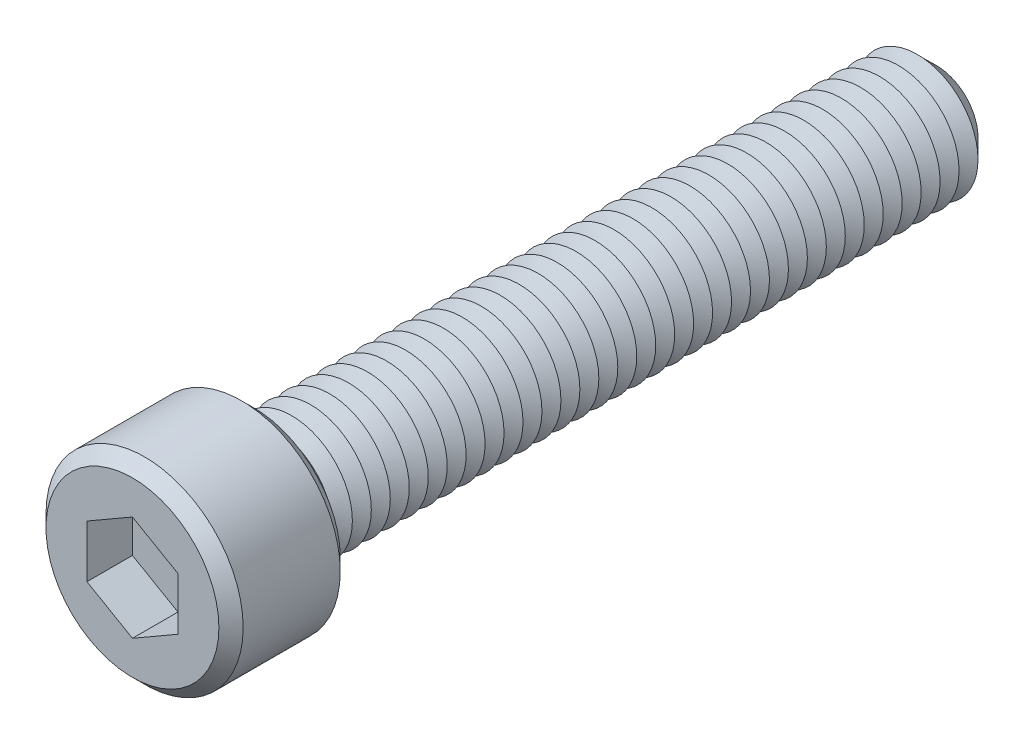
ISO-10303-21;
HEADER;
FILE_DESCRIPTION(('STEP AP214'),'2;1');
FILE_NAME('part.step','',(''),(''),'','','');
FILE_SCHEMA(('AUTOMOTIVE_DESIGN { 1 0 10303 214 1 1 1 1 }'));
ENDSEC;
DATA;
#1=APPLICATION_CONTEXT('core data for automotive mechanical design processes');
#2=APPLICATION_PROTOCOL_DEFINITION('international standard','automotive_design',2000,#1);
#3=PRODUCT_CONTEXT('',#1,'mechanical');
#4=PRODUCT('Part','Part','',(#3));
#5=PRODUCT_RELATED_PRODUCT_CATEGORY('part','',(#4));
#6=PRODUCT_DEFINITION_FORMATION('','',#4);
#7=PRODUCT_DEFINITION_CONTEXT('part definition',#1,'design');
#8=PRODUCT_DEFINITION('design','',#6,#7);
#9=PRODUCT_DEFINITION_SHAPE('','',#8);
#10=(LENGTH_UNIT() NAMED_UNIT(*) SI_UNIT(.MILLI.,.METRE.));
#11=(NAMED_UNIT(*) PLANE_ANGLE_UNIT() SI_UNIT($,.RADIAN.));
#12=(NAMED_UNIT(*) SI_UNIT($,.STERADIAN.) SOLID_ANGLE_UNIT());
#13=UNCERTAINTY_MEASURE_WITH_UNIT(LENGTH_MEASURE(1.E-05),#10,'distance_accuracy_value','');
#14=(GEOMETRIC_REPRESENTATION_CONTEXT(3) GLOBAL_UNCERTAINTY_ASSIGNED_CONTEXT((#13)) GLOBAL_UNIT_ASSIGNED_CONTEXT((#10,
#11,#12)) REPRESENTATION_CONTEXT('',''));
#15=CARTESIAN_POINT('',(0.,0.,0.));
#16=DIRECTION('',(0.,0.,1.));
#17=DIRECTION('',(1.,0.,0.));
#18=AXIS2_PLACEMENT_3D('',#15,#16,#17);
#19=CARTESIAN_POINT('',(0.,0.,8.));
#20=DIRECTION('',(0.,0.,-1.));
#21=DIRECTION('',(-1.,0.,0.));
#22=AXIS2_PLACEMENT_3D('',#19,#20,#21);
#23=CYLINDRICAL_SURFACE('',#22,6.5);
#24=CARTESIAN_POINT('',(0.,0.,0.799999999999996));
#25=DIRECTION('',(0.,0.,1.));
#26=DIRECTION('',(1.,0.,0.));
#27=AXIS2_PLACEMENT_3D('',#24,#25,#26);
#28=CIRCLE('',#27,6.5);
#29=CARTESIAN_POINT('',(6.5,0.,0.799999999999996));
#30=VERTEX_POINT('',#29);
#31=EDGE_CURVE('E456',#30,#30,#28,.T.);
#32=ORIENTED_EDGE('',*,*,#31,.T.);
#33=EDGE_LOOP('',(#32));
#34=FACE_BOUND('',#33,.T.);
#35=CARTESIAN_POINT('',(0.,0.,7.19999999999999));
#36=DIRECTION('',(0.,0.,1.));
#37=DIRECTION('',(1.,0.,0.));
#38=AXIS2_PLACEMENT_3D('',#35,#36,#37);
#39=CIRCLE('',#38,6.5);
#40=CARTESIAN_POINT('',(6.5,0.,7.19999999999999));
#41=VERTEX_POINT('',#40);
#42=EDGE_CURVE('E452',#41,#41,#39,.F.);
#43=ORIENTED_EDGE('',*,*,#42,.T.);
#44=EDGE_LOOP('',(#43));
#45=FACE_BOUND('',#44,.T.);
#46=ADVANCED_FACE('F39',(#34,#45),#23,.T.);
#47=CARTESIAN_POINT('',(0.,0.,8.));
#48=DIRECTION('',(0.,0.,1.));
#49=DIRECTION('',(1.,0.,0.));
#50=AXIS2_PLACEMENT_3D('',#47,#48,#49);
#51=PLANE('',#50);
#52=CARTESIAN_POINT('',(0.,0.,8.));
#53=DIRECTION('',(0.,0.,1.));
#54=DIRECTION('',(1.,0.,0.));
#55=AXIS2_PLACEMENT_3D('',#52,#53,#54);
#56=CIRCLE('',#55,5.7);
#57=CARTESIAN_POINT('',(5.7,0.,8.));
#58=VERTEX_POINT('',#57);
#59=EDGE_CURVE('E11',#58,#58,#56,.T.);
#60=ORIENTED_EDGE('',*,*,#59,.T.);
#61=EDGE_LOOP('',(#60));
#62=FACE_BOUND('',#61,.T.);
#63=DIRECTION('',(-0.866025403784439,0.5,0.));
#64=VECTOR('',#63,1.);
#65=CARTESIAN_POINT('',(3.,1.73205080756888,8.));
#66=LINE('',#65,#64);
#67=CARTESIAN_POINT('',(3.,1.73205080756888,8.));
#68=VERTEX_POINT('',#67);
#69=CARTESIAN_POINT('',(0.,3.46410161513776,8.));
#70=VERTEX_POINT('',#69);
#71=EDGE_CURVE('E55',#68,#70,#66,.T.);
#72=ORIENTED_EDGE('',*,*,#71,.F.);
#73=DIRECTION('',(0.,1.,0.));
#74=VECTOR('',#73,1.);
#75=CARTESIAN_POINT('',(3.,-1.73205080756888,8.));
#76=LINE('',#75,#74);
#77=CARTESIAN_POINT('',(3.,-1.73205080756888,8.));
#78=VERTEX_POINT('',#77);
#79=EDGE_CURVE('E150',#78,#68,#76,.T.);
#80=ORIENTED_EDGE('',*,*,#79,.F.);
#81=DIRECTION('',(0.866025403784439,0.5,0.));
#82=VECTOR('',#81,1.);
#83=CARTESIAN_POINT('',(0.,-3.46410161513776,8.));
#84=LINE('',#83,#82);
#85=CARTESIAN_POINT('',(0.,-3.46410161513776,8.));
#86=VERTEX_POINT('',#85);
#87=EDGE_CURVE('E147',#86,#78,#84,.T.);
#88=ORIENTED_EDGE('',*,*,#87,.F.);
#89=DIRECTION('',(0.866025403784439,-0.5,0.));
#90=VECTOR('',#89,1.);
#91=CARTESIAN_POINT('',(-3.,-1.73205080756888,8.));
#92=LINE('',#91,#90);
#93=CARTESIAN_POINT('',(-3.,-1.73205080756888,8.));
#94=VERTEX_POINT('',#93);
#95=EDGE_CURVE('E103',#94,#86,#92,.T.);
#96=ORIENTED_EDGE('',*,*,#95,.F.);
#97=DIRECTION('',(0.,-1.,0.));
#98=VECTOR('',#97,1.);
#99=CARTESIAN_POINT('',(-3.,1.73205080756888,8.));
#100=LINE('',#99,#98);
#101=CARTESIAN_POINT('',(-3.,1.73205080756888,8.));
#102=VERTEX_POINT('',#101);
#103=EDGE_CURVE('E141',#102,#94,#100,.T.);
#104=ORIENTED_EDGE('',*,*,#103,.F.);
#105=DIRECTION('',(-0.866025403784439,-0.5,0.));
#106=VECTOR('',#105,1.);
#107=CARTESIAN_POINT('',(0.,3.46410161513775,8.));
#108=LINE('',#107,#106);
#109=EDGE_CURVE('E137',#70,#102,#108,.T.);
#110=ORIENTED_EDGE('',*,*,#109,.F.);
#111=EDGE_LOOP('',(#72,#80,#88,#96,#104,#110));
#112=FACE_BOUND('',#111,.T.);
#113=ADVANCED_FACE('F474',(#62,#112),#51,.T.);
#114=CARTESIAN_POINT('',(0.,0.,0.));
#115=DIRECTION('',(0.,0.,1.));
#116=DIRECTION('',(1.,0.,0.));
#117=AXIS2_PLACEMENT_3D('',#114,#115,#116);
#118=PLANE('',#117);
#119=CARTESIAN_POINT('',(0.,0.,0.));
#120=DIRECTION('',(0.,0.,1.));
#121=DIRECTION('',(1.,0.,0.));
#122=AXIS2_PLACEMENT_3D('',#119,#120,#121);
#123=CIRCLE('',#122,5.7);
#124=CARTESIAN_POINT('',(5.7,0.,0.));
#125=VERTEX_POINT('',#124);
#126=EDGE_CURVE('E48',#125,#125,#123,.F.);
#127=ORIENTED_EDGE('',*,*,#126,.T.);
#128=EDGE_LOOP('',(#127));
#129=FACE_BOUND('',#128,.T.);
#130=CARTESIAN_POINT('',(0.,0.,0.));
#131=DIRECTION('',(0.,0.,1.));
#132=DIRECTION('',(1.,0.,0.));
#133=AXIS2_PLACEMENT_3D('',#130,#131,#132);
#134=CIRCLE('',#133,4.);
#135=CARTESIAN_POINT('',(4.,0.,0.));
#136=VERTEX_POINT('',#135);
#137=EDGE_CURVE('E444',#136,#136,#134,.T.);
#138=ORIENTED_EDGE('',*,*,#137,.T.);
#139=EDGE_LOOP('',(#138));
#140=FACE_BOUND('',#139,.T.);
#141=ADVANCED_FACE('F463',(#129,#140),#118,.F.);
#142=CARTESIAN_POINT('',(0.,0.,0.));
#143=DIRECTION('',(0.,0.,1.));
#144=DIRECTION('',(1.,0.,0.));
#145=AXIS2_PLACEMENT_3D('',#142,#143,#144);
#146=CONICAL_SURFACE('',#145,4.,1.0471975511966);
#147=CARTESIAN_POINT('',(0.,0.,-0.625));
#148=DIRECTION('',(0.,0.,1.));
#149=DIRECTION('',(1.,0.,0.));
#150=AXIS2_PLACEMENT_3D('',#147,#148,#149);
#151=CIRCLE('',#150,2.91746824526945);
#152=CARTESIAN_POINT('',(2.91746824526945,0.,-0.625));
#153=VERTEX_POINT('',#152);
#154=EDGE_CURVE('E440',#153,#153,#151,.T.);
#155=ORIENTED_EDGE('',*,*,#154,.T.);
#156=EDGE_LOOP('',(#155));
#157=FACE_BOUND('',#156,.T.);
#158=ORIENTED_EDGE('',*,*,#137,.F.);
#159=EDGE_LOOP('',(#158));
#160=FACE_BOUND('',#159,.T.);
#161=ADVANCED_FACE('F804',(#157,#160),#146,.T.);
#162=CARTESIAN_POINT('',(0.,0.,-0.625));
#163=DIRECTION('',(0.,0.,-1.));
#164=DIRECTION('',(-1.,0.,0.));
#165=AXIS2_PLACEMENT_3D('',#162,#163,#164);
#166=CONICAL_SURFACE('',#165,2.91746824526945,1.0471975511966);
#167=CARTESIAN_POINT('',(0.,0.,-1.25));
#168=DIRECTION('',(0.,0.,1.));
#169=DIRECTION('',(1.,0.,0.));
#170=AXIS2_PLACEMENT_3D('',#167,#168,#169);
#171=CIRCLE('',#170,4.);
#172=CARTESIAN_POINT('',(4.,0.,-1.25));
#173=VERTEX_POINT('',#172);
#174=EDGE_CURVE('E436',#173,#173,#171,.T.);
#175=ORIENTED_EDGE('',*,*,#174,.T.);
#176=EDGE_LOOP('',(#175));
#177=FACE_BOUND('',#176,.T.);
#178=ORIENTED_EDGE('',*,*,#154,.F.);
#179=EDGE_LOOP('',(#178));
#180=FACE_BOUND('',#179,.T.);
#181=ADVANCED_FACE('F800',(#177,#180),#166,.T.);
#182=CARTESIAN_POINT('',(0.,0.,-1.25));
#183=DIRECTION('',(0.,0.,1.));
#184=DIRECTION('',(1.,0.,0.));
#185=AXIS2_PLACEMENT_3D('',#182,#183,#184);
#186=CONICAL_SURFACE('',#185,4.,1.0471975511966);
#187=CARTESIAN_POINT('',(0.,0.,-1.875));
#188=DIRECTION('',(0.,0.,1.));
#189=DIRECTION('',(1.,0.,0.));
#190=AXIS2_PLACEMENT_3D('',#187,#188,#189);
#191=CIRCLE('',#190,2.91746824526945);
#192=CARTESIAN_POINT('',(2.91746824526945,0.,-1.875));
#193=VERTEX_POINT('',#192);
#194=EDGE_CURVE('E432',#193,#193,#191,.T.);
#195=ORIENTED_EDGE('',*,*,#194,.T.);
#196=EDGE_LOOP('',(#195));
#197=FACE_BOUND('',#196,.T.);
#198=ORIENTED_EDGE('',*,*,#174,.F.);
#199=EDGE_LOOP('',(#198));
#200=FACE_BOUND('',#199,.T.);
#201=ADVANCED_FACE('F796',(#197,#200),#186,.T.);
#202=CARTESIAN_POINT('',(0.,0.,-1.875));
#203=DIRECTION('',(0.,0.,-1.));
#204=DIRECTION('',(-1.,0.,0.));
#205=AXIS2_PLACEMENT_3D('',#202,#203,#204);
#206=CONICAL_SURFACE('',#205,2.91746824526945,1.0471975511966);
#207=CARTESIAN_POINT('',(0.,0.,-2.5));
#208=DIRECTION('',(0.,0.,1.));
#209=DIRECTION('',(1.,0.,0.));
#210=AXIS2_PLACEMENT_3D('',#207,#208,#209);
#211=CIRCLE('',#210,4.);
#212=CARTESIAN_POINT('',(4.,0.,-2.5));
#213=VERTEX_POINT('',#212);
#214=EDGE_CURVE('E428',#213,#213,#211,.T.);
#215=ORIENTED_EDGE('',*,*,#214,.T.);
#216=EDGE_LOOP('',(#215));
#217=FACE_BOUND('',#216,.T.);
#218=ORIENTED_EDGE('',*,*,#194,.F.);
#219=EDGE_LOOP('',(#218));
#220=FACE_BOUND('',#219,.T.);
#221=ADVANCED_FACE('F792',(#217,#220),#206,.T.);
#222=CARTESIAN_POINT('',(0.,0.,-2.5));
#223=DIRECTION('',(0.,0.,1.));
#224=DIRECTION('',(1.,0.,0.));
#225=AXIS2_PLACEMENT_3D('',#222,#223,#224);
#226=CONICAL_SURFACE('',#225,4.,1.0471975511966);
#227=CARTESIAN_POINT('',(0.,0.,-3.125));
#228=DIRECTION('',(0.,0.,1.));
#229=DIRECTION('',(1.,0.,0.));
#230=AXIS2_PLACEMENT_3D('',#227,#228,#229);
#231=CIRCLE('',#230,2.91746824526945);
#232=CARTESIAN_POINT('',(2.91746824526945,0.,-3.125));
#233=VERTEX_POINT('',#232);
#234=EDGE_CURVE('E424',#233,#233,#231,.T.);
#235=ORIENTED_EDGE('',*,*,#234,.T.);
#236=EDGE_LOOP('',(#235));
#237=FACE_BOUND('',#236,.T.);
#238=ORIENTED_EDGE('',*,*,#214,.F.);
#239=EDGE_LOOP('',(#238));
#240=FACE_BOUND('',#239,.T.);
#241=ADVANCED_FACE('F788',(#237,#240),#226,.T.);
#242=CARTESIAN_POINT('',(0.,0.,-3.125));
#243=DIRECTION('',(0.,0.,-1.));
#244=DIRECTION('',(-1.,0.,0.));
#245=AXIS2_PLACEMENT_3D('',#242,#243,#244);
#246=CONICAL_SURFACE('',#245,2.91746824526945,1.0471975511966);
#247=CARTESIAN_POINT('',(0.,0.,-3.75));
#248=DIRECTION('',(0.,0.,1.));
#249=DIRECTION('',(1.,0.,0.));
#250=AXIS2_PLACEMENT_3D('',#247,#248,#249);
#251=CIRCLE('',#250,4.);
#252=CARTESIAN_POINT('',(4.,0.,-3.75));
#253=VERTEX_POINT('',#252);
#254=EDGE_CURVE('E420',#253,#253,#251,.T.);
#255=ORIENTED_EDGE('',*,*,#254,.T.);
#256=EDGE_LOOP('',(#255));
#257=FACE_BOUND('',#256,.T.);
#258=ORIENTED_EDGE('',*,*,#234,.F.);
#259=EDGE_LOOP('',(#258));
#260=FACE_BOUND('',#259,.T.);
#261=ADVANCED_FACE('F784',(#257,#260),#246,.T.);
#262=CARTESIAN_POINT('',(0.,0.,-3.75));
#263=DIRECTION('',(0.,0.,1.));
#264=DIRECTION('',(1.,0.,0.));
#265=AXIS2_PLACEMENT_3D('',#262,#263,#264);
#266=CONICAL_SURFACE('',#265,4.,1.0471975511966);
#267=CARTESIAN_POINT('',(0.,0.,-4.375));
#268=DIRECTION('',(0.,0.,1.));
#269=DIRECTION('',(1.,0.,0.));
#270=AXIS2_PLACEMENT_3D('',#267,#268,#269);
#271=CIRCLE('',#270,2.91746824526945);
#272=CARTESIAN_POINT('',(2.91746824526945,0.,-4.375));
#273=VERTEX_POINT('',#272);
#274=EDGE_CURVE('E416',#273,#273,#271,.T.);
#275=ORIENTED_EDGE('',*,*,#274,.T.);
#276=EDGE_LOOP('',(#275));
#277=FACE_BOUND('',#276,.T.);
#278=ORIENTED_EDGE('',*,*,#254,.F.);
#279=EDGE_LOOP('',(#278));
#280=FACE_BOUND('',#279,.T.);
#281=ADVANCED_FACE('F780',(#277,#280),#266,.T.);
#282=CARTESIAN_POINT('',(0.,0.,-4.375));
#283=DIRECTION('',(0.,0.,-1.));
#284=DIRECTION('',(-1.,0.,0.));
#285=AXIS2_PLACEMENT_3D('',#282,#283,#284);
#286=CONICAL_SURFACE('',#285,2.91746824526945,1.0471975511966);
#287=CARTESIAN_POINT('',(0.,0.,-5.));
#288=DIRECTION('',(0.,0.,1.));
#289=DIRECTION('',(1.,0.,0.));
#290=AXIS2_PLACEMENT_3D('',#287,#288,#289);
#291=CIRCLE('',#290,4.);
#292=CARTESIAN_POINT('',(4.,0.,-5.));
#293=VERTEX_POINT('',#292);
#294=EDGE_CURVE('E412',#293,#293,#291,.T.);
#295=ORIENTED_EDGE('',*,*,#294,.T.);
#296=EDGE_LOOP('',(#295));
#297=FACE_BOUND('',#296,.T.);
#298=ORIENTED_EDGE('',*,*,#274,.F.);
#299=EDGE_LOOP('',(#298));
#300=FACE_BOUND('',#299,.T.);
#301=ADVANCED_FACE('F776',(#297,#300),#286,.T.);
#302=CARTESIAN_POINT('',(0.,0.,-5.));
#303=DIRECTION('',(0.,0.,1.));
#304=DIRECTION('',(1.,0.,0.));
#305=AXIS2_PLACEMENT_3D('',#302,#303,#304);
#306=CONICAL_SURFACE('',#305,4.,1.0471975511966);
#307=CARTESIAN_POINT('',(0.,0.,-5.625));
#308=DIRECTION('',(0.,0.,1.));
#309=DIRECTION('',(1.,0.,0.));
#310=AXIS2_PLACEMENT_3D('',#307,#308,#309);
#311=CIRCLE('',#310,2.91746824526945);
#312=CARTESIAN_POINT('',(2.91746824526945,0.,-5.625));
#313=VERTEX_POINT('',#312);
#314=EDGE_CURVE('E408',#313,#313,#311,.T.);
#315=ORIENTED_EDGE('',*,*,#314,.T.);
#316=EDGE_LOOP('',(#315));
#317=FACE_BOUND('',#316,.T.);
#318=ORIENTED_EDGE('',*,*,#294,.F.);
#319=EDGE_LOOP('',(#318));
#320=FACE_BOUND('',#319,.T.);
#321=ADVANCED_FACE('F772',(#317,#320),#306,.T.);
#322=CARTESIAN_POINT('',(0.,0.,-5.625));
#323=DIRECTION('',(0.,0.,-1.));
#324=DIRECTION('',(-1.,0.,0.));
#325=AXIS2_PLACEMENT_3D('',#322,#323,#324);
#326=CONICAL_SURFACE('',#325,2.91746824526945,1.0471975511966);
#327=CARTESIAN_POINT('',(0.,0.,-6.25));
#328=DIRECTION('',(0.,0.,1.));
#329=DIRECTION('',(1.,0.,0.));
#330=AXIS2_PLACEMENT_3D('',#327,#328,#329);
#331=CIRCLE('',#330,4.);
#332=CARTESIAN_POINT('',(4.,0.,-6.25));
#333=VERTEX_POINT('',#332);
#334=EDGE_CURVE('E404',#333,#333,#331,.T.);
#335=ORIENTED_EDGE('',*,*,#334,.T.);
#336=EDGE_LOOP('',(#335));
#337=FACE_BOUND('',#336,.T.);
#338=ORIENTED_EDGE('',*,*,#314,.F.);
#339=EDGE_LOOP('',(#338));
#340=FACE_BOUND('',#339,.T.);
#341=ADVANCED_FACE('F768',(#337,#340),#326,.T.);
#342=CARTESIAN_POINT('',(0.,0.,-6.25));
#343=DIRECTION('',(0.,0.,1.));
#344=DIRECTION('',(1.,0.,0.));
#345=AXIS2_PLACEMENT_3D('',#342,#343,#344);
#346=CONICAL_SURFACE('',#345,4.,1.0471975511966);
#347=CARTESIAN_POINT('',(0.,0.,-6.875));
#348=DIRECTION('',(0.,0.,1.));
#349=DIRECTION('',(1.,0.,0.));
#350=AXIS2_PLACEMENT_3D('',#347,#348,#349);
#351=CIRCLE('',#350,2.91746824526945);
#352=CARTESIAN_POINT('',(2.91746824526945,0.,-6.875));
#353=VERTEX_POINT('',#352);
#354=EDGE_CURVE('E400',#353,#353,#351,.T.);
#355=ORIENTED_EDGE('',*,*,#354,.T.);
#356=EDGE_LOOP('',(#355));
#357=FACE_BOUND('',#356,.T.);
#358=ORIENTED_EDGE('',*,*,#334,.F.);
#359=EDGE_LOOP('',(#358));
#360=FACE_BOUND('',#359,.T.);
#361=ADVANCED_FACE('F764',(#357,#360),#346,.T.);
#362=CARTESIAN_POINT('',(0.,0.,-6.875));
#363=DIRECTION('',(0.,0.,-1.));
#364=DIRECTION('',(-1.,0.,0.));
#365=AXIS2_PLACEMENT_3D('',#362,#363,#364);
#366=CONICAL_SURFACE('',#365,2.91746824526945,1.0471975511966);
#367=CARTESIAN_POINT('',(0.,0.,-7.5));
#368=DIRECTION('',(0.,0.,1.));
#369=DIRECTION('',(1.,0.,0.));
#370=AXIS2_PLACEMENT_3D('',#367,#368,#369);
#371=CIRCLE('',#370,4.);
#372=CARTESIAN_POINT('',(4.,0.,-7.5));
#373=VERTEX_POINT('',#372);
#374=EDGE_CURVE('E396',#373,#373,#371,.T.);
#375=ORIENTED_EDGE('',*,*,#374,.T.);
#376=EDGE_LOOP('',(#375));
#377=FACE_BOUND('',#376,.T.);
#378=ORIENTED_EDGE('',*,*,#354,.F.);
#379=EDGE_LOOP('',(#378));
#380=FACE_BOUND('',#379,.T.);
#381=ADVANCED_FACE('F760',(#377,#380),#366,.T.);
#382=CARTESIAN_POINT('',(0.,0.,-7.5));
#383=DIRECTION('',(0.,0.,1.));
#384=DIRECTION('',(1.,0.,0.));
#385=AXIS2_PLACEMENT_3D('',#382,#383,#384);
#386=CONICAL_SURFACE('',#385,4.,1.0471975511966);
#387=CARTESIAN_POINT('',(0.,0.,-8.125));
#388=DIRECTION('',(0.,0.,1.));
#389=DIRECTION('',(1.,0.,0.));
#390=AXIS2_PLACEMENT_3D('',#387,#388,#389);
#391=CIRCLE('',#390,2.91746824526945);
#392=CARTESIAN_POINT('',(2.91746824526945,0.,-8.125));
#393=VERTEX_POINT('',#392);
#394=EDGE_CURVE('E392',#393,#393,#391,.T.);
#395=ORIENTED_EDGE('',*,*,#394,.T.);
#396=EDGE_LOOP('',(#395));
#397=FACE_BOUND('',#396,.T.);
#398=ORIENTED_EDGE('',*,*,#374,.F.);
#399=EDGE_LOOP('',(#398));
#400=FACE_BOUND('',#399,.T.);
#401=ADVANCED_FACE('F756',(#397,#400),#386,.T.);
#402=CARTESIAN_POINT('',(0.,0.,-8.125));
#403=DIRECTION('',(0.,0.,-1.));
#404=DIRECTION('',(-1.,0.,0.));
#405=AXIS2_PLACEMENT_3D('',#402,#403,#404);
#406=CONICAL_SURFACE('',#405,2.91746824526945,1.0471975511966);
#407=CARTESIAN_POINT('',(0.,0.,-8.75));
#408=DIRECTION('',(0.,0.,1.));
#409=DIRECTION('',(1.,0.,0.));
#410=AXIS2_PLACEMENT_3D('',#407,#408,#409);
#411=CIRCLE('',#410,4.);
#412=CARTESIAN_POINT('',(4.,0.,-8.75));
#413=VERTEX_POINT('',#412);
#414=EDGE_CURVE('E388',#413,#413,#411,.T.);
#415=ORIENTED_EDGE('',*,*,#414,.T.);
#416=EDGE_LOOP('',(#415));
#417=FACE_BOUND('',#416,.T.);
#418=ORIENTED_EDGE('',*,*,#394,.F.);
#419=EDGE_LOOP('',(#418));
#420=FACE_BOUND('',#419,.T.);
#421=ADVANCED_FACE('F752',(#417,#420),#406,.T.);
#422=CARTESIAN_POINT('',(0.,0.,-8.75));
#423=DIRECTION('',(0.,0.,1.));
#424=DIRECTION('',(1.,0.,0.));
#425=AXIS2_PLACEMENT_3D('',#422,#423,#424);
#426=CONICAL_SURFACE('',#425,4.,1.0471975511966);
#427=CARTESIAN_POINT('',(0.,0.,-9.375));
#428=DIRECTION('',(0.,0.,1.));
#429=DIRECTION('',(1.,0.,0.));
#430=AXIS2_PLACEMENT_3D('',#427,#428,#429);
#431=CIRCLE('',#430,2.91746824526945);
#432=CARTESIAN_POINT('',(2.91746824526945,0.,-9.375));
#433=VERTEX_POINT('',#432);
#434=EDGE_CURVE('E384',#433,#433,#431,.T.);
#435=ORIENTED_EDGE('',*,*,#434,.T.);
#436=EDGE_LOOP('',(#435));
#437=FACE_BOUND('',#436,.T.);
#438=ORIENTED_EDGE('',*,*,#414,.F.);
#439=EDGE_LOOP('',(#438));
#440=FACE_BOUND('',#439,.T.);
#441=ADVANCED_FACE('F748',(#437,#440),#426,.T.);
#442=CARTESIAN_POINT('',(0.,0.,-9.375));
#443=DIRECTION('',(0.,0.,-1.));
#444=DIRECTION('',(-1.,0.,0.));
#445=AXIS2_PLACEMENT_3D('',#442,#443,#444);
#446=CONICAL_SURFACE('',#445,2.91746824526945,1.0471975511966);
#447=CARTESIAN_POINT('',(0.,0.,-10.));
#448=DIRECTION('',(0.,0.,1.));
#449=DIRECTION('',(1.,0.,0.));
#450=AXIS2_PLACEMENT_3D('',#447,#448,#449);
#451=CIRCLE('',#450,4.);
#452=CARTESIAN_POINT('',(4.,0.,-10.));
#453=VERTEX_POINT('',#452);
#454=EDGE_CURVE('E380',#453,#453,#451,.T.);
#455=ORIENTED_EDGE('',*,*,#454,.T.);
#456=EDGE_LOOP('',(#455));
#457=FACE_BOUND('',#456,.T.);
#458=ORIENTED_EDGE('',*,*,#434,.F.);
#459=EDGE_LOOP('',(#458));
#460=FACE_BOUND('',#459,.T.);
#461=ADVANCED_FACE('F744',(#457,#460),#446,.T.);
#462=CARTESIAN_POINT('',(0.,0.,-10.));
#463=DIRECTION('',(0.,0.,1.));
#464=DIRECTION('',(1.,0.,0.));
#465=AXIS2_PLACEMENT_3D('',#462,#463,#464);
#466=CONICAL_SURFACE('',#465,4.,1.0471975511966);
#467=CARTESIAN_POINT('',(0.,0.,-10.625));
#468=DIRECTION('',(0.,0.,1.));
#469=DIRECTION('',(1.,0.,0.));
#470=AXIS2_PLACEMENT_3D('',#467,#468,#469);
#471=CIRCLE('',#470,2.91746824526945);
#472=CARTESIAN_POINT('',(2.91746824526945,0.,-10.625));
#473=VERTEX_POINT('',#472);
#474=EDGE_CURVE('E376',#473,#473,#471,.T.);
#475=ORIENTED_EDGE('',*,*,#474,.T.);
#476=EDGE_LOOP('',(#475));
#477=FACE_BOUND('',#476,.T.);
#478=ORIENTED_EDGE('',*,*,#454,.F.);
#479=EDGE_LOOP('',(#478));
#480=FACE_BOUND('',#479,.T.);
#481=ADVANCED_FACE('F740',(#477,#480),#466,.T.);
#482=CARTESIAN_POINT('',(0.,0.,-10.625));
#483=DIRECTION('',(0.,0.,-1.));
#484=DIRECTION('',(-1.,0.,0.));
#485=AXIS2_PLACEMENT_3D('',#482,#483,#484);
#486=CONICAL_SURFACE('',#485,2.91746824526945,1.0471975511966);
#487=CARTESIAN_POINT('',(0.,0.,-11.25));
#488=DIRECTION('',(0.,0.,1.));
#489=DIRECTION('',(1.,0.,0.));
#490=AXIS2_PLACEMENT_3D('',#487,#488,#489);
#491=CIRCLE('',#490,4.);
#492=CARTESIAN_POINT('',(4.,0.,-11.25));
#493=VERTEX_POINT('',#492);
#494=EDGE_CURVE('E372',#493,#493,#491,.T.);
#495=ORIENTED_EDGE('',*,*,#494,.T.);
#496=EDGE_LOOP('',(#495));
#497=FACE_BOUND('',#496,.T.);
#498=ORIENTED_EDGE('',*,*,#474,.F.);
#499=EDGE_LOOP('',(#498));
#500=FACE_BOUND('',#499,.T.);
#501=ADVANCED_FACE('F736',(#497,#500),#486,.T.);
#502=CARTESIAN_POINT('',(0.,0.,-11.25));
#503=DIRECTION('',(0.,0.,1.));
#504=DIRECTION('',(1.,0.,0.));
#505=AXIS2_PLACEMENT_3D('',#502,#503,#504);
#506=CONICAL_SURFACE('',#505,4.,1.0471975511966);
#507=CARTESIAN_POINT('',(0.,0.,-11.875));
#508=DIRECTION('',(0.,0.,1.));
#509=DIRECTION('',(1.,0.,0.));
#510=AXIS2_PLACEMENT_3D('',#507,#508,#509);
#511=CIRCLE('',#510,2.91746824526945);
#512=CARTESIAN_POINT('',(2.91746824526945,0.,-11.875));
#513=VERTEX_POINT('',#512);
#514=EDGE_CURVE('E368',#513,#513,#511,.T.);
#515=ORIENTED_EDGE('',*,*,#514,.T.);
#516=EDGE_LOOP('',(#515));
#517=FACE_BOUND('',#516,.T.);
#518=ORIENTED_EDGE('',*,*,#494,.F.);
#519=EDGE_LOOP('',(#518));
#520=FACE_BOUND('',#519,.T.);
#521=ADVANCED_FACE('F732',(#517,#520),#506,.T.);
#522=CARTESIAN_POINT('',(0.,0.,-11.875));
#523=DIRECTION('',(0.,0.,-1.));
#524=DIRECTION('',(-1.,0.,0.));
#525=AXIS2_PLACEMENT_3D('',#522,#523,#524);
#526=CONICAL_SURFACE('',#525,2.91746824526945,1.0471975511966);
#527=CARTESIAN_POINT('',(0.,0.,-12.5));
#528=DIRECTION('',(0.,0.,1.));
#529=DIRECTION('',(1.,0.,0.));
#530=AXIS2_PLACEMENT_3D('',#527,#528,#529);
#531=CIRCLE('',#530,4.);
#532=CARTESIAN_POINT('',(4.,0.,-12.5));
#533=VERTEX_POINT('',#532);
#534=EDGE_CURVE('E364',#533,#533,#531,.T.);
#535=ORIENTED_EDGE('',*,*,#534,.T.);
#536=EDGE_LOOP('',(#535));
#537=FACE_BOUND('',#536,.T.);
#538=ORIENTED_EDGE('',*,*,#514,.F.);
#539=EDGE_LOOP('',(#538));
#540=FACE_BOUND('',#539,.T.);
#541=ADVANCED_FACE('F728',(#537,#540),#526,.T.);
#542=CARTESIAN_POINT('',(0.,0.,-12.5));
#543=DIRECTION('',(0.,0.,1.));
#544=DIRECTION('',(1.,0.,0.));
#545=AXIS2_PLACEMENT_3D('',#542,#543,#544);
#546=CONICAL_SURFACE('',#545,4.,1.0471975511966);
#547=CARTESIAN_POINT('',(0.,0.,-13.125));
#548=DIRECTION('',(0.,0.,1.));
#549=DIRECTION('',(1.,0.,0.));
#550=AXIS2_PLACEMENT_3D('',#547,#548,#549);
#551=CIRCLE('',#550,2.91746824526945);
#552=CARTESIAN_POINT('',(2.91746824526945,0.,-13.125));
#553=VERTEX_POINT('',#552);
#554=EDGE_CURVE('E360',#553,#553,#551,.T.);
#555=ORIENTED_EDGE('',*,*,#554,.T.);
#556=EDGE_LOOP('',(#555));
#557=FACE_BOUND('',#556,.T.);
#558=ORIENTED_EDGE('',*,*,#534,.F.);
#559=EDGE_LOOP('',(#558));
#560=FACE_BOUND('',#559,.T.);
#561=ADVANCED_FACE('F724',(#557,#560),#546,.T.);
#562=CARTESIAN_POINT('',(0.,0.,-13.125));
#563=DIRECTION('',(0.,0.,-1.));
#564=DIRECTION('',(-1.,0.,0.));
#565=AXIS2_PLACEMENT_3D('',#562,#563,#564);
#566=CONICAL_SURFACE('',#565,2.91746824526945,1.0471975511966);
#567=CARTESIAN_POINT('',(0.,0.,-13.75));
#568=DIRECTION('',(0.,0.,1.));
#569=DIRECTION('',(1.,0.,0.));
#570=AXIS2_PLACEMENT_3D('',#567,#568,#569);
#571=CIRCLE('',#570,4.);
#572=CARTESIAN_POINT('',(4.,0.,-13.75));
#573=VERTEX_POINT('',#572);
#574=EDGE_CURVE('E356',#573,#573,#571,.T.);
#575=ORIENTED_EDGE('',*,*,#574,.T.);
#576=EDGE_LOOP('',(#575));
#577=FACE_BOUND('',#576,.T.);
#578=ORIENTED_EDGE('',*,*,#554,.F.);
#579=EDGE_LOOP('',(#578));
#580=FACE_BOUND('',#579,.T.);
#581=ADVANCED_FACE('F720',(#577,#580),#566,.T.);
#582=CARTESIAN_POINT('',(0.,0.,-13.75));
#583=DIRECTION('',(0.,0.,1.));
#584=DIRECTION('',(1.,0.,0.));
#585=AXIS2_PLACEMENT_3D('',#582,#583,#584);
#586=CONICAL_SURFACE('',#585,4.,1.0471975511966);
#587=CARTESIAN_POINT('',(0.,0.,-14.375));
#588=DIRECTION('',(0.,0.,1.));
#589=DIRECTION('',(1.,0.,0.));
#590=AXIS2_PLACEMENT_3D('',#587,#588,#589);
#591=CIRCLE('',#590,2.91746824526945);
#592=CARTESIAN_POINT('',(2.91746824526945,0.,-14.375));
#593=VERTEX_POINT('',#592);
#594=EDGE_CURVE('E352',#593,#593,#591,.T.);
#595=ORIENTED_EDGE('',*,*,#594,.T.);
#596=EDGE_LOOP('',(#595));
#597=FACE_BOUND('',#596,.T.);
#598=ORIENTED_EDGE('',*,*,#574,.F.);
#599=EDGE_LOOP('',(#598));
#600=FACE_BOUND('',#599,.T.);
#601=ADVANCED_FACE('F716',(#597,#600),#586,.T.);
#602=CARTESIAN_POINT('',(0.,0.,-14.375));
#603=DIRECTION('',(0.,0.,-1.));
#604=DIRECTION('',(-1.,0.,0.));
#605=AXIS2_PLACEMENT_3D('',#602,#603,#604);
#606=CONICAL_SURFACE('',#605,2.91746824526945,1.0471975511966);
#607=CARTESIAN_POINT('',(0.,0.,-15.));
#608=DIRECTION('',(0.,0.,1.));
#609=DIRECTION('',(1.,0.,0.));
#610=AXIS2_PLACEMENT_3D('',#607,#608,#609);
#611=CIRCLE('',#610,4.);
#612=CARTESIAN_POINT('',(4.,0.,-15.));
#613=VERTEX_POINT('',#612);
#614=EDGE_CURVE('E348',#613,#613,#611,.T.);
#615=ORIENTED_EDGE('',*,*,#614,.T.);
#616=EDGE_LOOP('',(#615));
#617=FACE_BOUND('',#616,.T.);
#618=ORIENTED_EDGE('',*,*,#594,.F.);
#619=EDGE_LOOP('',(#618));
#620=FACE_BOUND('',#619,.T.);
#621=ADVANCED_FACE('F712',(#617,#620),#606,.T.);
#622=CARTESIAN_POINT('',(0.,0.,-15.));
#623=DIRECTION('',(0.,0.,1.));
#624=DIRECTION('',(1.,0.,0.));
#625=AXIS2_PLACEMENT_3D('',#622,#623,#624);
#626=CONICAL_SURFACE('',#625,4.,1.0471975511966);
#627=CARTESIAN_POINT('',(0.,0.,-15.625));
#628=DIRECTION('',(0.,0.,1.));
#629=DIRECTION('',(1.,0.,0.));
#630=AXIS2_PLACEMENT_3D('',#627,#628,#629);
#631=CIRCLE('',#630,2.91746824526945);
#632=CARTESIAN_POINT('',(2.91746824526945,0.,-15.625));
#633=VERTEX_POINT('',#632);
#634=EDGE_CURVE('E344',#633,#633,#631,.T.);
#635=ORIENTED_EDGE('',*,*,#634,.T.);
#636=EDGE_LOOP('',(#635));
#637=FACE_BOUND('',#636,.T.);
#638=ORIENTED_EDGE('',*,*,#614,.F.);
#639=EDGE_LOOP('',(#638));
#640=FACE_BOUND('',#639,.T.);
#641=ADVANCED_FACE('F708',(#637,#640),#626,.T.);
#642=CARTESIAN_POINT('',(0.,0.,-15.625));
#643=DIRECTION('',(0.,0.,-1.));
#644=DIRECTION('',(-1.,0.,0.));
#645=AXIS2_PLACEMENT_3D('',#642,#643,#644);
#646=CONICAL_SURFACE('',#645,2.91746824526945,1.0471975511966);
#647=CARTESIAN_POINT('',(0.,0.,-16.25));
#648=DIRECTION('',(0.,0.,1.));
#649=DIRECTION('',(1.,0.,0.));
#650=AXIS2_PLACEMENT_3D('',#647,#648,#649);
#651=CIRCLE('',#650,4.);
#652=CARTESIAN_POINT('',(4.,0.,-16.25));
#653=VERTEX_POINT('',#652);
#654=EDGE_CURVE('E340',#653,#653,#651,.T.);
#655=ORIENTED_EDGE('',*,*,#654,.T.);
#656=EDGE_LOOP('',(#655));
#657=FACE_BOUND('',#656,.T.);
#658=ORIENTED_EDGE('',*,*,#634,.F.);
#659=EDGE_LOOP('',(#658));
#660=FACE_BOUND('',#659,.T.);
#661=ADVANCED_FACE('F704',(#657,#660),#646,.T.);
#662=CARTESIAN_POINT('',(0.,0.,-16.25));
#663=DIRECTION('',(0.,0.,1.));
#664=DIRECTION('',(1.,0.,0.));
#665=AXIS2_PLACEMENT_3D('',#662,#663,#664);
#666=CONICAL_SURFACE('',#665,4.,1.0471975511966);
#667=CARTESIAN_POINT('',(0.,0.,-16.875));
#668=DIRECTION('',(0.,0.,1.));
#669=DIRECTION('',(1.,0.,0.));
#670=AXIS2_PLACEMENT_3D('',#667,#668,#669);
#671=CIRCLE('',#670,2.91746824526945);
#672=CARTESIAN_POINT('',(2.91746824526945,0.,-16.875));
#673=VERTEX_POINT('',#672);
#674=EDGE_CURVE('E336',#673,#673,#671,.T.);
#675=ORIENTED_EDGE('',*,*,#674,.T.);
#676=EDGE_LOOP('',(#675));
#677=FACE_BOUND('',#676,.T.);
#678=ORIENTED_EDGE('',*,*,#654,.F.);
#679=EDGE_LOOP('',(#678));
#680=FACE_BOUND('',#679,.T.);
#681=ADVANCED_FACE('F700',(#677,#680),#666,.T.);
#682=CARTESIAN_POINT('',(0.,0.,-16.875));
#683=DIRECTION('',(0.,0.,-1.));
#684=DIRECTION('',(-1.,0.,0.));
#685=AXIS2_PLACEMENT_3D('',#682,#683,#684);
#686=CONICAL_SURFACE('',#685,2.91746824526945,1.0471975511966);
#687=CARTESIAN_POINT('',(0.,0.,-17.5));
#688=DIRECTION('',(0.,0.,1.));
#689=DIRECTION('',(1.,0.,0.));
#690=AXIS2_PLACEMENT_3D('',#687,#688,#689);
#691=CIRCLE('',#690,4.);
#692=CARTESIAN_POINT('',(4.,0.,-17.5));
#693=VERTEX_POINT('',#692);
#694=EDGE_CURVE('E332',#693,#693,#691,.T.);
#695=ORIENTED_EDGE('',*,*,#694,.T.);
#696=EDGE_LOOP('',(#695));
#697=FACE_BOUND('',#696,.T.);
#698=ORIENTED_EDGE('',*,*,#674,.F.);
#699=EDGE_LOOP('',(#698));
#700=FACE_BOUND('',#699,.T.);
#701=ADVANCED_FACE('F696',(#697,#700),#686,.T.);
#702=CARTESIAN_POINT('',(0.,0.,-17.5));
#703=DIRECTION('',(0.,0.,1.));
#704=DIRECTION('',(1.,0.,0.));
#705=AXIS2_PLACEMENT_3D('',#702,#703,#704);
#706=CONICAL_SURFACE('',#705,4.,1.0471975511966);
#707=CARTESIAN_POINT('',(0.,0.,-18.125));
#708=DIRECTION('',(0.,0.,1.));
#709=DIRECTION('',(1.,0.,0.));
#710=AXIS2_PLACEMENT_3D('',#707,#708,#709);
#711=CIRCLE('',#710,2.91746824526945);
#712=CARTESIAN_POINT('',(2.91746824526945,0.,-18.125));
#713=VERTEX_POINT('',#712);
#714=EDGE_CURVE('E328',#713,#713,#711,.T.);
#715=ORIENTED_EDGE('',*,*,#714,.T.);
#716=EDGE_LOOP('',(#715));
#717=FACE_BOUND('',#716,.T.);
#718=ORIENTED_EDGE('',*,*,#694,.F.);
#719=EDGE_LOOP('',(#718));
#720=FACE_BOUND('',#719,.T.);
#721=ADVANCED_FACE('F692',(#717,#720),#706,.T.);
#722=CARTESIAN_POINT('',(0.,0.,-18.125));
#723=DIRECTION('',(0.,0.,-1.));
#724=DIRECTION('',(-1.,0.,0.));
#725=AXIS2_PLACEMENT_3D('',#722,#723,#724);
#726=CONICAL_SURFACE('',#725,2.91746824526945,1.0471975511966);
#727=CARTESIAN_POINT('',(0.,0.,-18.75));
#728=DIRECTION('',(0.,0.,1.));
#729=DIRECTION('',(1.,0.,0.));
#730=AXIS2_PLACEMENT_3D('',#727,#728,#729);
#731=CIRCLE('',#730,4.);
#732=CARTESIAN_POINT('',(4.,0.,-18.75));
#733=VERTEX_POINT('',#732);
#734=EDGE_CURVE('E324',#733,#733,#731,.T.);
#735=ORIENTED_EDGE('',*,*,#734,.T.);
#736=EDGE_LOOP('',(#735));
#737=FACE_BOUND('',#736,.T.);
#738=ORIENTED_EDGE('',*,*,#714,.F.);
#739=EDGE_LOOP('',(#738));
#740=FACE_BOUND('',#739,.T.);
#741=ADVANCED_FACE('F688',(#737,#740),#726,.T.);
#742=CARTESIAN_POINT('',(0.,0.,-18.75));
#743=DIRECTION('',(0.,0.,1.));
#744=DIRECTION('',(1.,0.,0.));
#745=AXIS2_PLACEMENT_3D('',#742,#743,#744);
#746=CONICAL_SURFACE('',#745,4.,1.0471975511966);
#747=CARTESIAN_POINT('',(0.,0.,-19.375));
#748=DIRECTION('',(0.,0.,1.));
#749=DIRECTION('',(1.,0.,0.));
#750=AXIS2_PLACEMENT_3D('',#747,#748,#749);
#751=CIRCLE('',#750,2.91746824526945);
#752=CARTESIAN_POINT('',(2.91746824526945,0.,-19.375));
#753=VERTEX_POINT('',#752);
#754=EDGE_CURVE('E320',#753,#753,#751,.T.);
#755=ORIENTED_EDGE('',*,*,#754,.T.);
#756=EDGE_LOOP('',(#755));
#757=FACE_BOUND('',#756,.T.);
#758=ORIENTED_EDGE('',*,*,#734,.F.);
#759=EDGE_LOOP('',(#758));
#760=FACE_BOUND('',#759,.T.);
#761=ADVANCED_FACE('F684',(#757,#760),#746,.T.);
#762=CARTESIAN_POINT('',(0.,0.,-19.375));
#763=DIRECTION('',(0.,0.,-1.));
#764=DIRECTION('',(-1.,0.,0.));
#765=AXIS2_PLACEMENT_3D('',#762,#763,#764);
#766=CONICAL_SURFACE('',#765,2.91746824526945,1.0471975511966);
#767=CARTESIAN_POINT('',(0.,0.,-20.));
#768=DIRECTION('',(0.,0.,1.));
#769=DIRECTION('',(1.,0.,0.));
#770=AXIS2_PLACEMENT_3D('',#767,#768,#769);
#771=CIRCLE('',#770,4.);
#772=CARTESIAN_POINT('',(4.,0.,-20.));
#773=VERTEX_POINT('',#772);
#774=EDGE_CURVE('E316',#773,#773,#771,.T.);
#775=ORIENTED_EDGE('',*,*,#774,.T.);
#776=EDGE_LOOP('',(#775));
#777=FACE_BOUND('',#776,.T.);
#778=ORIENTED_EDGE('',*,*,#754,.F.);
#779=EDGE_LOOP('',(#778));
#780=FACE_BOUND('',#779,.T.);
#781=ADVANCED_FACE('F680',(#777,#780),#766,.T.);
#782=CARTESIAN_POINT('',(0.,0.,-20.));
#783=DIRECTION('',(0.,0.,1.));
#784=DIRECTION('',(1.,0.,0.));
#785=AXIS2_PLACEMENT_3D('',#782,#783,#784);
#786=CONICAL_SURFACE('',#785,4.,1.0471975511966);
#787=CARTESIAN_POINT('',(0.,0.,-20.625));
#788=DIRECTION('',(0.,0.,1.));
#789=DIRECTION('',(1.,0.,0.));
#790=AXIS2_PLACEMENT_3D('',#787,#788,#789);
#791=CIRCLE('',#790,2.91746824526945);
#792=CARTESIAN_POINT('',(2.91746824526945,0.,-20.625));
#793=VERTEX_POINT('',#792);
#794=EDGE_CURVE('E312',#793,#793,#791,.T.);
#795=ORIENTED_EDGE('',*,*,#794,.T.);
#796=EDGE_LOOP('',(#795));
#797=FACE_BOUND('',#796,.T.);
#798=ORIENTED_EDGE('',*,*,#774,.F.);
#799=EDGE_LOOP('',(#798));
#800=FACE_BOUND('',#799,.T.);
#801=ADVANCED_FACE('F676',(#797,#800),#786,.T.);
#802=CARTESIAN_POINT('',(0.,0.,-20.625));
#803=DIRECTION('',(0.,0.,-1.));
#804=DIRECTION('',(-1.,0.,0.));
#805=AXIS2_PLACEMENT_3D('',#802,#803,#804);
#806=CONICAL_SURFACE('',#805,2.91746824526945,1.0471975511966);
#807=CARTESIAN_POINT('',(0.,0.,-21.25));
#808=DIRECTION('',(0.,0.,1.));
#809=DIRECTION('',(1.,0.,0.));
#810=AXIS2_PLACEMENT_3D('',#807,#808,#809);
#811=CIRCLE('',#810,4.);
#812=CARTESIAN_POINT('',(4.,0.,-21.25));
#813=VERTEX_POINT('',#812);
#814=EDGE_CURVE('E308',#813,#813,#811,.T.);
#815=ORIENTED_EDGE('',*,*,#814,.T.);
#816=EDGE_LOOP('',(#815));
#817=FACE_BOUND('',#816,.T.);
#818=ORIENTED_EDGE('',*,*,#794,.F.);
#819=EDGE_LOOP('',(#818));
#820=FACE_BOUND('',#819,.T.);
#821=ADVANCED_FACE('F672',(#817,#820),#806,.T.);
#822=CARTESIAN_POINT('',(0.,0.,-21.25));
#823=DIRECTION('',(0.,0.,1.));
#824=DIRECTION('',(1.,0.,0.));
#825=AXIS2_PLACEMENT_3D('',#822,#823,#824);
#826=CONICAL_SURFACE('',#825,4.,1.0471975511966);
#827=CARTESIAN_POINT('',(0.,0.,-21.875));
#828=DIRECTION('',(0.,0.,1.));
#829=DIRECTION('',(1.,0.,0.));
#830=AXIS2_PLACEMENT_3D('',#827,#828,#829);
#831=CIRCLE('',#830,2.91746824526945);
#832=CARTESIAN_POINT('',(2.91746824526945,0.,-21.875));
#833=VERTEX_POINT('',#832);
#834=EDGE_CURVE('E304',#833,#833,#831,.T.);
#835=ORIENTED_EDGE('',*,*,#834,.T.);
#836=EDGE_LOOP('',(#835));
#837=FACE_BOUND('',#836,.T.);
#838=ORIENTED_EDGE('',*,*,#814,.F.);
#839=EDGE_LOOP('',(#838));
#840=FACE_BOUND('',#839,.T.);
#841=ADVANCED_FACE('F668',(#837,#840),#826,.T.);
#842=CARTESIAN_POINT('',(0.,0.,-21.875));
#843=DIRECTION('',(0.,0.,-1.));
#844=DIRECTION('',(-1.,0.,0.));
#845=AXIS2_PLACEMENT_3D('',#842,#843,#844);
#846=CONICAL_SURFACE('',#845,2.91746824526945,1.0471975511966);
#847=CARTESIAN_POINT('',(0.,0.,-22.5));
#848=DIRECTION('',(0.,0.,1.));
#849=DIRECTION('',(1.,0.,0.));
#850=AXIS2_PLACEMENT_3D('',#847,#848,#849);
#851=CIRCLE('',#850,4.);
#852=CARTESIAN_POINT('',(4.,0.,-22.5));
#853=VERTEX_POINT('',#852);
#854=EDGE_CURVE('E300',#853,#853,#851,.T.);
#855=ORIENTED_EDGE('',*,*,#854,.T.);
#856=EDGE_LOOP('',(#855));
#857=FACE_BOUND('',#856,.T.);
#858=ORIENTED_EDGE('',*,*,#834,.F.);
#859=EDGE_LOOP('',(#858));
#860=FACE_BOUND('',#859,.T.);
#861=ADVANCED_FACE('F664',(#857,#860),#846,.T.);
#862=CARTESIAN_POINT('',(0.,0.,-22.5));
#863=DIRECTION('',(0.,0.,1.));
#864=DIRECTION('',(1.,0.,0.));
#865=AXIS2_PLACEMENT_3D('',#862,#863,#864);
#866=CONICAL_SURFACE('',#865,4.,1.0471975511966);
#867=CARTESIAN_POINT('',(0.,0.,-23.125));
#868=DIRECTION('',(0.,0.,1.));
#869=DIRECTION('',(1.,0.,0.));
#870=AXIS2_PLACEMENT_3D('',#867,#868,#869);
#871=CIRCLE('',#870,2.91746824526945);
#872=CARTESIAN_POINT('',(2.91746824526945,0.,-23.125));
#873=VERTEX_POINT('',#872);
#874=EDGE_CURVE('E296',#873,#873,#871,.T.);
#875=ORIENTED_EDGE('',*,*,#874,.T.);
#876=EDGE_LOOP('',(#875));
#877=FACE_BOUND('',#876,.T.);
#878=ORIENTED_EDGE('',*,*,#854,.F.);
#879=EDGE_LOOP('',(#878));
#880=FACE_BOUND('',#879,.T.);
#881=ADVANCED_FACE('F660',(#877,#880),#866,.T.);
#882=CARTESIAN_POINT('',(0.,0.,-23.125));
#883=DIRECTION('',(0.,0.,-1.));
#884=DIRECTION('',(-1.,0.,0.));
#885=AXIS2_PLACEMENT_3D('',#882,#883,#884);
#886=CONICAL_SURFACE('',#885,2.91746824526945,1.0471975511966);
#887=CARTESIAN_POINT('',(0.,0.,-23.75));
#888=DIRECTION('',(0.,0.,1.));
#889=DIRECTION('',(1.,0.,0.));
#890=AXIS2_PLACEMENT_3D('',#887,#888,#889);
#891=CIRCLE('',#890,4.);
#892=CARTESIAN_POINT('',(4.,0.,-23.75));
#893=VERTEX_POINT('',#892);
#894=EDGE_CURVE('E292',#893,#893,#891,.T.);
#895=ORIENTED_EDGE('',*,*,#894,.T.);
#896=EDGE_LOOP('',(#895));
#897=FACE_BOUND('',#896,.T.);
#898=ORIENTED_EDGE('',*,*,#874,.F.);
#899=EDGE_LOOP('',(#898));
#900=FACE_BOUND('',#899,.T.);
#901=ADVANCED_FACE('F656',(#897,#900),#886,.T.);
#902=CARTESIAN_POINT('',(0.,0.,-23.75));
#903=DIRECTION('',(0.,0.,1.));
#904=DIRECTION('',(1.,0.,0.));
#905=AXIS2_PLACEMENT_3D('',#902,#903,#904);
#906=CONICAL_SURFACE('',#905,4.,1.0471975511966);
#907=CARTESIAN_POINT('',(0.,0.,-24.375));
#908=DIRECTION('',(0.,0.,1.));
#909=DIRECTION('',(1.,0.,0.));
#910=AXIS2_PLACEMENT_3D('',#907,#908,#909);
#911=CIRCLE('',#910,2.91746824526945);
#912=CARTESIAN_POINT('',(2.91746824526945,0.,-24.375));
#913=VERTEX_POINT('',#912);
#914=EDGE_CURVE('E288',#913,#913,#911,.T.);
#915=ORIENTED_EDGE('',*,*,#914,.T.);
#916=EDGE_LOOP('',(#915));
#917=FACE_BOUND('',#916,.T.);
#918=ORIENTED_EDGE('',*,*,#894,.F.);
#919=EDGE_LOOP('',(#918));
#920=FACE_BOUND('',#919,.T.);
#921=ADVANCED_FACE('F652',(#917,#920),#906,.T.);
#922=CARTESIAN_POINT('',(0.,0.,-24.375));
#923=DIRECTION('',(0.,0.,-1.));
#924=DIRECTION('',(-1.,0.,0.));
#925=AXIS2_PLACEMENT_3D('',#922,#923,#924);
#926=CONICAL_SURFACE('',#925,2.91746824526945,1.0471975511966);
#927=CARTESIAN_POINT('',(0.,0.,-25.));
#928=DIRECTION('',(0.,0.,1.));
#929=DIRECTION('',(1.,0.,0.));
#930=AXIS2_PLACEMENT_3D('',#927,#928,#929);
#931=CIRCLE('',#930,4.);
#932=CARTESIAN_POINT('',(4.,0.,-25.));
#933=VERTEX_POINT('',#932);
#934=EDGE_CURVE('E284',#933,#933,#931,.T.);
#935=ORIENTED_EDGE('',*,*,#934,.T.);
#936=EDGE_LOOP('',(#935));
#937=FACE_BOUND('',#936,.T.);
#938=ORIENTED_EDGE('',*,*,#914,.F.);
#939=EDGE_LOOP('',(#938));
#940=FACE_BOUND('',#939,.T.);
#941=ADVANCED_FACE('F648',(#937,#940),#926,.T.);
#942=CARTESIAN_POINT('',(0.,0.,-25.));
#943=DIRECTION('',(0.,0.,1.));
#944=DIRECTION('',(1.,0.,0.));
#945=AXIS2_PLACEMENT_3D('',#942,#943,#944);
#946=CONICAL_SURFACE('',#945,4.,1.0471975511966);
#947=CARTESIAN_POINT('',(0.,0.,-25.625));
#948=DIRECTION('',(0.,0.,1.));
#949=DIRECTION('',(1.,0.,0.));
#950=AXIS2_PLACEMENT_3D('',#947,#948,#949);
#951=CIRCLE('',#950,2.91746824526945);
#952=CARTESIAN_POINT('',(2.91746824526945,0.,-25.625));
#953=VERTEX_POINT('',#952);
#954=EDGE_CURVE('E280',#953,#953,#951,.T.);
#955=ORIENTED_EDGE('',*,*,#954,.T.);
#956=EDGE_LOOP('',(#955));
#957=FACE_BOUND('',#956,.T.);
#958=ORIENTED_EDGE('',*,*,#934,.F.);
#959=EDGE_LOOP('',(#958));
#960=FACE_BOUND('',#959,.T.);
#961=ADVANCED_FACE('F644',(#957,#960),#946,.T.);
#962=CARTESIAN_POINT('',(0.,0.,-25.625));
#963=DIRECTION('',(0.,0.,-1.));
#964=DIRECTION('',(-1.,0.,0.));
#965=AXIS2_PLACEMENT_3D('',#962,#963,#964);
#966=CONICAL_SURFACE('',#965,2.91746824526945,1.0471975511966);
#967=CARTESIAN_POINT('',(0.,0.,-26.25));
#968=DIRECTION('',(0.,0.,1.));
#969=DIRECTION('',(1.,0.,0.));
#970=AXIS2_PLACEMENT_3D('',#967,#968,#969);
#971=CIRCLE('',#970,4.);
#972=CARTESIAN_POINT('',(4.,0.,-26.25));
#973=VERTEX_POINT('',#972);
#974=EDGE_CURVE('E276',#973,#973,#971,.T.);
#975=ORIENTED_EDGE('',*,*,#974,.T.);
#976=EDGE_LOOP('',(#975));
#977=FACE_BOUND('',#976,.T.);
#978=ORIENTED_EDGE('',*,*,#954,.F.);
#979=EDGE_LOOP('',(#978));
#980=FACE_BOUND('',#979,.T.);
#981=ADVANCED_FACE('F640',(#977,#980),#966,.T.);
#982=CARTESIAN_POINT('',(0.,0.,-26.25));
#983=DIRECTION('',(0.,0.,1.));
#984=DIRECTION('',(1.,0.,0.));
#985=AXIS2_PLACEMENT_3D('',#982,#983,#984);
#986=CONICAL_SURFACE('',#985,4.,1.0471975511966);
#987=CARTESIAN_POINT('',(0.,0.,-26.875));
#988=DIRECTION('',(0.,0.,1.));
#989=DIRECTION('',(1.,0.,0.));
#990=AXIS2_PLACEMENT_3D('',#987,#988,#989);
#991=CIRCLE('',#990,2.91746824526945);
#992=CARTESIAN_POINT('',(2.91746824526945,0.,-26.875));
#993=VERTEX_POINT('',#992);
#994=EDGE_CURVE('E272',#993,#993,#991,.T.);
#995=ORIENTED_EDGE('',*,*,#994,.T.);
#996=EDGE_LOOP('',(#995));
#997=FACE_BOUND('',#996,.T.);
#998=ORIENTED_EDGE('',*,*,#974,.F.);
#999=EDGE_LOOP('',(#998));
#1000=FACE_BOUND('',#999,.T.);
#1001=ADVANCED_FACE('F636',(#997,#1000),#986,.T.);
#1002=CARTESIAN_POINT('',(0.,0.,-26.875));
#1003=DIRECTION('',(0.,0.,-1.));
#1004=DIRECTION('',(-1.,0.,0.));
#1005=AXIS2_PLACEMENT_3D('',#1002,#1003,#1004);
#1006=CONICAL_SURFACE('',#1005,2.91746824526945,1.0471975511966);
#1007=CARTESIAN_POINT('',(0.,0.,-27.5));
#1008=DIRECTION('',(0.,0.,1.));
#1009=DIRECTION('',(1.,0.,0.));
#1010=AXIS2_PLACEMENT_3D('',#1007,#1008,#1009);
#1011=CIRCLE('',#1010,4.);
#1012=CARTESIAN_POINT('',(4.,0.,-27.5));
#1013=VERTEX_POINT('',#1012);
#1014=EDGE_CURVE('E268',#1013,#1013,#1011,.T.);
#1015=ORIENTED_EDGE('',*,*,#1014,.T.);
#1016=EDGE_LOOP('',(#1015));
#1017=FACE_BOUND('',#1016,.T.);
#1018=ORIENTED_EDGE('',*,*,#994,.F.);
#1019=EDGE_LOOP('',(#1018));
#1020=FACE_BOUND('',#1019,.T.);
#1021=ADVANCED_FACE('F632',(#1017,#1020),#1006,.T.);
#1022=CARTESIAN_POINT('',(0.,0.,-27.5));
#1023=DIRECTION('',(0.,0.,1.));
#1024=DIRECTION('',(1.,0.,0.));
#1025=AXIS2_PLACEMENT_3D('',#1022,#1023,#1024);
#1026=CONICAL_SURFACE('',#1025,4.,1.0471975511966);
#1027=CARTESIAN_POINT('',(0.,0.,-28.125));
#1028=DIRECTION('',(0.,0.,1.));
#1029=DIRECTION('',(1.,0.,0.));
#1030=AXIS2_PLACEMENT_3D('',#1027,#1028,#1029);
#1031=CIRCLE('',#1030,2.91746824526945);
#1032=CARTESIAN_POINT('',(2.91746824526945,0.,-28.125));
#1033=VERTEX_POINT('',#1032);
#1034=EDGE_CURVE('E264',#1033,#1033,#1031,.T.);
#1035=ORIENTED_EDGE('',*,*,#1034,.T.);
#1036=EDGE_LOOP('',(#1035));
#1037=FACE_BOUND('',#1036,.T.);
#1038=ORIENTED_EDGE('',*,*,#1014,.F.);
#1039=EDGE_LOOP('',(#1038));
#1040=FACE_BOUND('',#1039,.T.);
#1041=ADVANCED_FACE('F628',(#1037,#1040),#1026,.T.);
#1042=CARTESIAN_POINT('',(0.,0.,-28.125));
#1043=DIRECTION('',(0.,0.,-1.));
#1044=DIRECTION('',(-1.,0.,0.));
#1045=AXIS2_PLACEMENT_3D('',#1042,#1043,#1044);
#1046=CONICAL_SURFACE('',#1045,2.91746824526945,1.0471975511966);
#1047=CARTESIAN_POINT('',(0.,0.,-28.75));
#1048=DIRECTION('',(0.,0.,1.));
#1049=DIRECTION('',(1.,0.,0.));
#1050=AXIS2_PLACEMENT_3D('',#1047,#1048,#1049);
#1051=CIRCLE('',#1050,4.);
#1052=CARTESIAN_POINT('',(4.,0.,-28.75));
#1053=VERTEX_POINT('',#1052);
#1054=EDGE_CURVE('E260',#1053,#1053,#1051,.T.);
#1055=ORIENTED_EDGE('',*,*,#1054,.T.);
#1056=EDGE_LOOP('',(#1055));
#1057=FACE_BOUND('',#1056,.T.);
#1058=ORIENTED_EDGE('',*,*,#1034,.F.);
#1059=EDGE_LOOP('',(#1058));
#1060=FACE_BOUND('',#1059,.T.);
#1061=ADVANCED_FACE('F624',(#1057,#1060),#1046,.T.);
#1062=CARTESIAN_POINT('',(0.,0.,-28.75));
#1063=DIRECTION('',(0.,0.,1.));
#1064=DIRECTION('',(1.,0.,0.));
#1065=AXIS2_PLACEMENT_3D('',#1062,#1063,#1064);
#1066=CONICAL_SURFACE('',#1065,4.,1.0471975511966);
#1067=CARTESIAN_POINT('',(0.,0.,-29.375));
#1068=DIRECTION('',(0.,0.,1.));
#1069=DIRECTION('',(1.,0.,0.));
#1070=AXIS2_PLACEMENT_3D('',#1067,#1068,#1069);
#1071=CIRCLE('',#1070,2.91746824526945);
#1072=CARTESIAN_POINT('',(2.91746824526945,0.,-29.375));
#1073=VERTEX_POINT('',#1072);
#1074=EDGE_CURVE('E256',#1073,#1073,#1071,.T.);
#1075=ORIENTED_EDGE('',*,*,#1074,.T.);
#1076=EDGE_LOOP('',(#1075));
#1077=FACE_BOUND('',#1076,.T.);
#1078=ORIENTED_EDGE('',*,*,#1054,.F.);
#1079=EDGE_LOOP('',(#1078));
#1080=FACE_BOUND('',#1079,.T.);
#1081=ADVANCED_FACE('F620',(#1077,#1080),#1066,.T.);
#1082=CARTESIAN_POINT('',(0.,0.,-29.375));
#1083=DIRECTION('',(0.,0.,-1.));
#1084=DIRECTION('',(-1.,0.,0.));
#1085=AXIS2_PLACEMENT_3D('',#1082,#1083,#1084);
#1086=CONICAL_SURFACE('',#1085,2.91746824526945,1.0471975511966);
#1087=CARTESIAN_POINT('',(0.,0.,-30.));
#1088=DIRECTION('',(0.,0.,1.));
#1089=DIRECTION('',(1.,0.,0.));
#1090=AXIS2_PLACEMENT_3D('',#1087,#1088,#1089);
#1091=CIRCLE('',#1090,4.);
#1092=CARTESIAN_POINT('',(4.,0.,-30.));
#1093=VERTEX_POINT('',#1092);
#1094=EDGE_CURVE('E252',#1093,#1093,#1091,.T.);
#1095=ORIENTED_EDGE('',*,*,#1094,.T.);
#1096=EDGE_LOOP('',(#1095));
#1097=FACE_BOUND('',#1096,.T.);
#1098=ORIENTED_EDGE('',*,*,#1074,.F.);
#1099=EDGE_LOOP('',(#1098));
#1100=FACE_BOUND('',#1099,.T.);
#1101=ADVANCED_FACE('F616',(#1097,#1100),#1086,.T.);
#1102=CARTESIAN_POINT('',(0.,0.,-30.));
#1103=DIRECTION('',(0.,0.,1.));
#1104=DIRECTION('',(1.,0.,0.));
#1105=AXIS2_PLACEMENT_3D('',#1102,#1103,#1104);
#1106=CONICAL_SURFACE('',#1105,4.,1.0471975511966);
#1107=CARTESIAN_POINT('',(0.,0.,-30.625));
#1108=DIRECTION('',(0.,0.,1.));
#1109=DIRECTION('',(1.,0.,0.));
#1110=AXIS2_PLACEMENT_3D('',#1107,#1108,#1109);
#1111=CIRCLE('',#1110,2.91746824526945);
#1112=CARTESIAN_POINT('',(2.91746824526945,0.,-30.625));
#1113=VERTEX_POINT('',#1112);
#1114=EDGE_CURVE('E248',#1113,#1113,#1111,.T.);
#1115=ORIENTED_EDGE('',*,*,#1114,.T.);
#1116=EDGE_LOOP('',(#1115));
#1117=FACE_BOUND('',#1116,.T.);
#1118=ORIENTED_EDGE('',*,*,#1094,.F.);
#1119=EDGE_LOOP('',(#1118));
#1120=FACE_BOUND('',#1119,.T.);
#1121=ADVANCED_FACE('F612',(#1117,#1120),#1106,.T.);
#1122=CARTESIAN_POINT('',(0.,0.,-30.625));
#1123=DIRECTION('',(0.,0.,-1.));
#1124=DIRECTION('',(-1.,0.,0.));
#1125=AXIS2_PLACEMENT_3D('',#1122,#1123,#1124);
#1126=CONICAL_SURFACE('',#1125,2.91746824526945,1.0471975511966);
#1127=CARTESIAN_POINT('',(0.,0.,-31.25));
#1128=DIRECTION('',(0.,0.,1.));
#1129=DIRECTION('',(1.,0.,0.));
#1130=AXIS2_PLACEMENT_3D('',#1127,#1128,#1129);
#1131=CIRCLE('',#1130,4.);
#1132=CARTESIAN_POINT('',(4.,0.,-31.25));
#1133=VERTEX_POINT('',#1132);
#1134=EDGE_CURVE('E244',#1133,#1133,#1131,.T.);
#1135=ORIENTED_EDGE('',*,*,#1134,.T.);
#1136=EDGE_LOOP('',(#1135));
#1137=FACE_BOUND('',#1136,.T.);
#1138=ORIENTED_EDGE('',*,*,#1114,.F.);
#1139=EDGE_LOOP('',(#1138));
#1140=FACE_BOUND('',#1139,.T.);
#1141=ADVANCED_FACE('F608',(#1137,#1140),#1126,.T.);
#1142=CARTESIAN_POINT('',(0.,0.,-31.25));
#1143=DIRECTION('',(0.,0.,1.));
#1144=DIRECTION('',(1.,0.,0.));
#1145=AXIS2_PLACEMENT_3D('',#1142,#1143,#1144);
#1146=CONICAL_SURFACE('',#1145,4.,1.0471975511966);
#1147=CARTESIAN_POINT('',(0.,0.,-31.875));
#1148=DIRECTION('',(0.,0.,1.));
#1149=DIRECTION('',(1.,0.,0.));
#1150=AXIS2_PLACEMENT_3D('',#1147,#1148,#1149);
#1151=CIRCLE('',#1150,2.91746824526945);
#1152=CARTESIAN_POINT('',(2.91746824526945,0.,-31.875));
#1153=VERTEX_POINT('',#1152);
#1154=EDGE_CURVE('E240',#1153,#1153,#1151,.T.);
#1155=ORIENTED_EDGE('',*,*,#1154,.T.);
#1156=EDGE_LOOP('',(#1155));
#1157=FACE_BOUND('',#1156,.T.);
#1158=ORIENTED_EDGE('',*,*,#1134,.F.);
#1159=EDGE_LOOP('',(#1158));
#1160=FACE_BOUND('',#1159,.T.);
#1161=ADVANCED_FACE('F604',(#1157,#1160),#1146,.T.);
#1162=CARTESIAN_POINT('',(0.,0.,-31.875));
#1163=DIRECTION('',(0.,0.,-1.));
#1164=DIRECTION('',(-1.,0.,0.));
#1165=AXIS2_PLACEMENT_3D('',#1162,#1163,#1164);
#1166=CONICAL_SURFACE('',#1165,2.91746824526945,1.0471975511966);
#1167=CARTESIAN_POINT('',(0.,0.,-32.5));
#1168=DIRECTION('',(0.,0.,1.));
#1169=DIRECTION('',(1.,0.,0.));
#1170=AXIS2_PLACEMENT_3D('',#1167,#1168,#1169);
#1171=CIRCLE('',#1170,4.);
#1172=CARTESIAN_POINT('',(4.,0.,-32.5));
#1173=VERTEX_POINT('',#1172);
#1174=EDGE_CURVE('E236',#1173,#1173,#1171,.T.);
#1175=ORIENTED_EDGE('',*,*,#1174,.T.);
#1176=EDGE_LOOP('',(#1175));
#1177=FACE_BOUND('',#1176,.T.);
#1178=ORIENTED_EDGE('',*,*,#1154,.F.);
#1179=EDGE_LOOP('',(#1178));
#1180=FACE_BOUND('',#1179,.T.);
#1181=ADVANCED_FACE('F600',(#1177,#1180),#1166,.T.);
#1182=CARTESIAN_POINT('',(0.,0.,-32.5));
#1183=DIRECTION('',(0.,0.,1.));
#1184=DIRECTION('',(1.,0.,0.));
#1185=AXIS2_PLACEMENT_3D('',#1182,#1183,#1184);
#1186=CONICAL_SURFACE('',#1185,4.,1.0471975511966);
#1187=CARTESIAN_POINT('',(0.,0.,-33.125));
#1188=DIRECTION('',(0.,0.,1.));
#1189=DIRECTION('',(1.,0.,0.));
#1190=AXIS2_PLACEMENT_3D('',#1187,#1188,#1189);
#1191=CIRCLE('',#1190,2.91746824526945);
#1192=CARTESIAN_POINT('',(2.91746824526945,0.,-33.125));
#1193=VERTEX_POINT('',#1192);
#1194=EDGE_CURVE('E232',#1193,#1193,#1191,.T.);
#1195=ORIENTED_EDGE('',*,*,#1194,.T.);
#1196=EDGE_LOOP('',(#1195));
#1197=FACE_BOUND('',#1196,.T.);
#1198=ORIENTED_EDGE('',*,*,#1174,.F.);
#1199=EDGE_LOOP('',(#1198));
#1200=FACE_BOUND('',#1199,.T.);
#1201=ADVANCED_FACE('F596',(#1197,#1200),#1186,.T.);
#1202=CARTESIAN_POINT('',(0.,0.,-33.125));
#1203=DIRECTION('',(0.,0.,-1.));
#1204=DIRECTION('',(-1.,0.,0.));
#1205=AXIS2_PLACEMENT_3D('',#1202,#1203,#1204);
#1206=CONICAL_SURFACE('',#1205,2.91746824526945,1.0471975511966);
#1207=CARTESIAN_POINT('',(0.,0.,-33.75));
#1208=DIRECTION('',(0.,0.,1.));
#1209=DIRECTION('',(1.,0.,0.));
#1210=AXIS2_PLACEMENT_3D('',#1207,#1208,#1209);
#1211=CIRCLE('',#1210,4.);
#1212=CARTESIAN_POINT('',(4.,0.,-33.75));
#1213=VERTEX_POINT('',#1212);
#1214=EDGE_CURVE('E228',#1213,#1213,#1211,.T.);
#1215=ORIENTED_EDGE('',*,*,#1214,.T.);
#1216=EDGE_LOOP('',(#1215));
#1217=FACE_BOUND('',#1216,.T.);
#1218=ORIENTED_EDGE('',*,*,#1194,.F.);
#1219=EDGE_LOOP('',(#1218));
#1220=FACE_BOUND('',#1219,.T.);
#1221=ADVANCED_FACE('F592',(#1217,#1220),#1206,.T.);
#1222=CARTESIAN_POINT('',(0.,0.,-33.75));
#1223=DIRECTION('',(0.,0.,1.));
#1224=DIRECTION('',(1.,0.,0.));
#1225=AXIS2_PLACEMENT_3D('',#1222,#1223,#1224);
#1226=CONICAL_SURFACE('',#1225,4.,1.0471975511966);
#1227=CARTESIAN_POINT('',(0.,0.,-34.375));
#1228=DIRECTION('',(0.,0.,1.));
#1229=DIRECTION('',(1.,0.,0.));
#1230=AXIS2_PLACEMENT_3D('',#1227,#1228,#1229);
#1231=CIRCLE('',#1230,2.91746824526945);
#1232=CARTESIAN_POINT('',(2.91746824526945,0.,-34.375));
#1233=VERTEX_POINT('',#1232);
#1234=EDGE_CURVE('E224',#1233,#1233,#1231,.T.);
#1235=ORIENTED_EDGE('',*,*,#1234,.T.);
#1236=EDGE_LOOP('',(#1235));
#1237=FACE_BOUND('',#1236,.T.);
#1238=ORIENTED_EDGE('',*,*,#1214,.F.);
#1239=EDGE_LOOP('',(#1238));
#1240=FACE_BOUND('',#1239,.T.);
#1241=ADVANCED_FACE('F588',(#1237,#1240),#1226,.T.);
#1242=CARTESIAN_POINT('',(0.,0.,-34.375));
#1243=DIRECTION('',(0.,0.,-1.));
#1244=DIRECTION('',(-1.,0.,0.));
#1245=AXIS2_PLACEMENT_3D('',#1242,#1243,#1244);
#1246=CONICAL_SURFACE('',#1245,2.91746824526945,1.0471975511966);
#1247=CARTESIAN_POINT('',(0.,0.,-35.));
#1248=DIRECTION('',(0.,0.,1.));
#1249=DIRECTION('',(1.,0.,0.));
#1250=AXIS2_PLACEMENT_3D('',#1247,#1248,#1249);
#1251=CIRCLE('',#1250,4.);
#1252=CARTESIAN_POINT('',(4.,0.,-35.));
#1253=VERTEX_POINT('',#1252);
#1254=EDGE_CURVE('E220',#1253,#1253,#1251,.T.);
#1255=ORIENTED_EDGE('',*,*,#1254,.T.);
#1256=EDGE_LOOP('',(#1255));
#1257=FACE_BOUND('',#1256,.T.);
#1258=ORIENTED_EDGE('',*,*,#1234,.F.);
#1259=EDGE_LOOP('',(#1258));
#1260=FACE_BOUND('',#1259,.T.);
#1261=ADVANCED_FACE('F584',(#1257,#1260),#1246,.T.);
#1262=CARTESIAN_POINT('',(0.,0.,-35.));
#1263=DIRECTION('',(0.,0.,1.));
#1264=DIRECTION('',(1.,0.,0.));
#1265=AXIS2_PLACEMENT_3D('',#1262,#1263,#1264);
#1266=CONICAL_SURFACE('',#1265,4.,1.0471975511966);
#1267=CARTESIAN_POINT('',(0.,0.,-35.625));
#1268=DIRECTION('',(0.,0.,1.));
#1269=DIRECTION('',(1.,0.,0.));
#1270=AXIS2_PLACEMENT_3D('',#1267,#1268,#1269);
#1271=CIRCLE('',#1270,2.91746824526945);
#1272=CARTESIAN_POINT('',(2.91746824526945,0.,-35.625));
#1273=VERTEX_POINT('',#1272);
#1274=EDGE_CURVE('E216',#1273,#1273,#1271,.T.);
#1275=ORIENTED_EDGE('',*,*,#1274,.T.);
#1276=EDGE_LOOP('',(#1275));
#1277=FACE_BOUND('',#1276,.T.);
#1278=ORIENTED_EDGE('',*,*,#1254,.F.);
#1279=EDGE_LOOP('',(#1278));
#1280=FACE_BOUND('',#1279,.T.);
#1281=ADVANCED_FACE('F580',(#1277,#1280),#1266,.T.);
#1282=CARTESIAN_POINT('',(0.,0.,-35.625));
#1283=DIRECTION('',(0.,0.,-1.));
#1284=DIRECTION('',(-1.,0.,0.));
#1285=AXIS2_PLACEMENT_3D('',#1282,#1283,#1284);
#1286=CONICAL_SURFACE('',#1285,2.91746824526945,1.0471975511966);
#1287=CARTESIAN_POINT('',(0.,0.,-36.25));
#1288=DIRECTION('',(0.,0.,1.));
#1289=DIRECTION('',(1.,0.,0.));
#1290=AXIS2_PLACEMENT_3D('',#1287,#1288,#1289);
#1291=CIRCLE('',#1290,4.);
#1292=CARTESIAN_POINT('',(4.,0.,-36.25));
#1293=VERTEX_POINT('',#1292);
#1294=EDGE_CURVE('E212',#1293,#1293,#1291,.T.);
#1295=ORIENTED_EDGE('',*,*,#1294,.T.);
#1296=EDGE_LOOP('',(#1295));
#1297=FACE_BOUND('',#1296,.T.);
#1298=ORIENTED_EDGE('',*,*,#1274,.F.);
#1299=EDGE_LOOP('',(#1298));
#1300=FACE_BOUND('',#1299,.T.);
#1301=ADVANCED_FACE('F576',(#1297,#1300),#1286,.T.);
#1302=CARTESIAN_POINT('',(0.,0.,-36.25));
#1303=DIRECTION('',(0.,0.,1.));
#1304=DIRECTION('',(1.,0.,0.));
#1305=AXIS2_PLACEMENT_3D('',#1302,#1303,#1304);
#1306=CONICAL_SURFACE('',#1305,4.,1.0471975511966);
#1307=CARTESIAN_POINT('',(0.,0.,-36.875));
#1308=DIRECTION('',(0.,0.,1.));
#1309=DIRECTION('',(1.,0.,0.));
#1310=AXIS2_PLACEMENT_3D('',#1307,#1308,#1309);
#1311=CIRCLE('',#1310,2.91746824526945);
#1312=CARTESIAN_POINT('',(2.91746824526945,0.,-36.875));
#1313=VERTEX_POINT('',#1312);
#1314=EDGE_CURVE('E208',#1313,#1313,#1311,.T.);
#1315=ORIENTED_EDGE('',*,*,#1314,.T.);
#1316=EDGE_LOOP('',(#1315));
#1317=FACE_BOUND('',#1316,.T.);
#1318=ORIENTED_EDGE('',*,*,#1294,.F.);
#1319=EDGE_LOOP('',(#1318));
#1320=FACE_BOUND('',#1319,.T.);
#1321=ADVANCED_FACE('F572',(#1317,#1320),#1306,.T.);
#1322=CARTESIAN_POINT('',(0.,0.,-36.875));
#1323=DIRECTION('',(0.,0.,-1.));
#1324=DIRECTION('',(-1.,0.,0.));
#1325=AXIS2_PLACEMENT_3D('',#1322,#1323,#1324);
#1326=CONICAL_SURFACE('',#1325,2.91746824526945,1.0471975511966);
#1327=CARTESIAN_POINT('',(0.,0.,-37.5));
#1328=DIRECTION('',(0.,0.,1.));
#1329=DIRECTION('',(1.,0.,0.));
#1330=AXIS2_PLACEMENT_3D('',#1327,#1328,#1329);
#1331=CIRCLE('',#1330,4.);
#1332=CARTESIAN_POINT('',(4.,0.,-37.5));
#1333=VERTEX_POINT('',#1332);
#1334=EDGE_CURVE('E204',#1333,#1333,#1331,.T.);
#1335=ORIENTED_EDGE('',*,*,#1334,.T.);
#1336=EDGE_LOOP('',(#1335));
#1337=FACE_BOUND('',#1336,.T.);
#1338=ORIENTED_EDGE('',*,*,#1314,.F.);
#1339=EDGE_LOOP('',(#1338));
#1340=FACE_BOUND('',#1339,.T.);
#1341=ADVANCED_FACE('F568',(#1337,#1340),#1326,.T.);
#1342=CARTESIAN_POINT('',(0.,0.,-37.5));
#1343=DIRECTION('',(0.,0.,1.));
#1344=DIRECTION('',(1.,0.,0.));
#1345=AXIS2_PLACEMENT_3D('',#1342,#1343,#1344);
#1346=CONICAL_SURFACE('',#1345,4.,1.0471975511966);
#1347=CARTESIAN_POINT('',(0.,0.,-38.125));
#1348=DIRECTION('',(0.,0.,1.));
#1349=DIRECTION('',(1.,0.,0.));
#1350=AXIS2_PLACEMENT_3D('',#1347,#1348,#1349);
#1351=CIRCLE('',#1350,2.91746824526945);
#1352=CARTESIAN_POINT('',(2.91746824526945,0.,-38.125));
#1353=VERTEX_POINT('',#1352);
#1354=EDGE_CURVE('E200',#1353,#1353,#1351,.T.);
#1355=ORIENTED_EDGE('',*,*,#1354,.T.);
#1356=EDGE_LOOP('',(#1355));
#1357=FACE_BOUND('',#1356,.T.);
#1358=ORIENTED_EDGE('',*,*,#1334,.F.);
#1359=EDGE_LOOP('',(#1358));
#1360=FACE_BOUND('',#1359,.T.);
#1361=ADVANCED_FACE('F564',(#1357,#1360),#1346,.T.);
#1362=CARTESIAN_POINT('',(0.,0.,-38.125));
#1363=DIRECTION('',(0.,0.,-1.));
#1364=DIRECTION('',(-1.,0.,0.));
#1365=AXIS2_PLACEMENT_3D('',#1362,#1363,#1364);
#1366=CONICAL_SURFACE('',#1365,2.91746824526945,1.0471975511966);
#1367=CARTESIAN_POINT('',(0.,0.,-38.75));
#1368=DIRECTION('',(0.,0.,1.));
#1369=DIRECTION('',(1.,0.,0.));
#1370=AXIS2_PLACEMENT_3D('',#1367,#1368,#1369);
#1371=CIRCLE('',#1370,4.);
#1372=CARTESIAN_POINT('',(4.,0.,-38.75));
#1373=VERTEX_POINT('',#1372);
#1374=EDGE_CURVE('E196',#1373,#1373,#1371,.T.);
#1375=ORIENTED_EDGE('',*,*,#1374,.T.);
#1376=EDGE_LOOP('',(#1375));
#1377=FACE_BOUND('',#1376,.T.);
#1378=ORIENTED_EDGE('',*,*,#1354,.F.);
#1379=EDGE_LOOP('',(#1378));
#1380=FACE_BOUND('',#1379,.T.);
#1381=ADVANCED_FACE('F560',(#1377,#1380),#1366,.T.);
#1382=CARTESIAN_POINT('',(0.,0.,-38.75));
#1383=DIRECTION('',(0.,0.,1.));
#1384=DIRECTION('',(1.,0.,0.));
#1385=AXIS2_PLACEMENT_3D('',#1382,#1383,#1384);
#1386=CONICAL_SURFACE('',#1385,4.,1.0471975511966);
#1387=CARTESIAN_POINT('',(0.,0.,-39.375));
#1388=DIRECTION('',(0.,0.,1.));
#1389=DIRECTION('',(1.,0.,0.));
#1390=AXIS2_PLACEMENT_3D('',#1387,#1388,#1389);
#1391=CIRCLE('',#1390,2.91746824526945);
#1392=CARTESIAN_POINT('',(2.91746824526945,0.,-39.375));
#1393=VERTEX_POINT('',#1392);
#1394=EDGE_CURVE('E192',#1393,#1393,#1391,.T.);
#1395=ORIENTED_EDGE('',*,*,#1394,.T.);
#1396=EDGE_LOOP('',(#1395));
#1397=FACE_BOUND('',#1396,.T.);
#1398=ORIENTED_EDGE('',*,*,#1374,.F.);
#1399=EDGE_LOOP('',(#1398));
#1400=FACE_BOUND('',#1399,.T.);
#1401=ADVANCED_FACE('F556',(#1397,#1400),#1386,.T.);
#1402=CARTESIAN_POINT('',(0.,0.,-39.375));
#1403=DIRECTION('',(0.,0.,-1.));
#1404=DIRECTION('',(-1.,0.,0.));
#1405=AXIS2_PLACEMENT_3D('',#1402,#1403,#1404);
#1406=CONICAL_SURFACE('',#1405,2.91746824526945,1.0471975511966);
#1407=CARTESIAN_POINT('',(0.,0.,-40.));
#1408=DIRECTION('',(0.,0.,1.));
#1409=DIRECTION('',(1.,0.,0.));
#1410=AXIS2_PLACEMENT_3D('',#1407,#1408,#1409);
#1411=CIRCLE('',#1410,4.);
#1412=CARTESIAN_POINT('',(4.,0.,-40.));
#1413=VERTEX_POINT('',#1412);
#1414=EDGE_CURVE('E188',#1413,#1413,#1411,.T.);
#1415=ORIENTED_EDGE('',*,*,#1414,.T.);
#1416=EDGE_LOOP('',(#1415));
#1417=FACE_BOUND('',#1416,.T.);
#1418=ORIENTED_EDGE('',*,*,#1394,.F.);
#1419=EDGE_LOOP('',(#1418));
#1420=FACE_BOUND('',#1419,.T.);
#1421=ADVANCED_FACE('F552',(#1417,#1420),#1406,.T.);
#1422=CARTESIAN_POINT('',(0.,0.,-40.));
#1423=DIRECTION('',(0.,0.,1.));
#1424=DIRECTION('',(1.,0.,0.));
#1425=AXIS2_PLACEMENT_3D('',#1422,#1423,#1424);
#1426=CONICAL_SURFACE('',#1425,4.,1.0471975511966);
#1427=CARTESIAN_POINT('',(0.,0.,-40.625));
#1428=DIRECTION('',(0.,0.,1.));
#1429=DIRECTION('',(1.,0.,0.));
#1430=AXIS2_PLACEMENT_3D('',#1427,#1428,#1429);
#1431=CIRCLE('',#1430,2.91746824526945);
#1432=CARTESIAN_POINT('',(2.91746824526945,0.,-40.625));
#1433=VERTEX_POINT('',#1432);
#1434=EDGE_CURVE('E184',#1433,#1433,#1431,.T.);
#1435=ORIENTED_EDGE('',*,*,#1434,.T.);
#1436=EDGE_LOOP('',(#1435));
#1437=FACE_BOUND('',#1436,.T.);
#1438=ORIENTED_EDGE('',*,*,#1414,.F.);
#1439=EDGE_LOOP('',(#1438));
#1440=FACE_BOUND('',#1439,.T.);
#1441=ADVANCED_FACE('F548',(#1437,#1440),#1426,.T.);
#1442=CARTESIAN_POINT('',(0.,0.,-40.625));
#1443=DIRECTION('',(0.,0.,-1.));
#1444=DIRECTION('',(-1.,0.,0.));
#1445=AXIS2_PLACEMENT_3D('',#1442,#1443,#1444);
#1446=CONICAL_SURFACE('',#1445,2.91746824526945,1.0471975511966);
#1447=CARTESIAN_POINT('',(0.,0.,-41.25));
#1448=DIRECTION('',(0.,0.,1.));
#1449=DIRECTION('',(1.,0.,0.));
#1450=AXIS2_PLACEMENT_3D('',#1447,#1448,#1449);
#1451=CIRCLE('',#1450,4.);
#1452=CARTESIAN_POINT('',(4.,0.,-41.25));
#1453=VERTEX_POINT('',#1452);
#1454=EDGE_CURVE('E180',#1453,#1453,#1451,.T.);
#1455=ORIENTED_EDGE('',*,*,#1454,.T.);
#1456=EDGE_LOOP('',(#1455));
#1457=FACE_BOUND('',#1456,.T.);
#1458=ORIENTED_EDGE('',*,*,#1434,.F.);
#1459=EDGE_LOOP('',(#1458));
#1460=FACE_BOUND('',#1459,.T.);
#1461=ADVANCED_FACE('F544',(#1457,#1460),#1446,.T.);
#1462=CARTESIAN_POINT('',(0.,0.,-41.25));
#1463=DIRECTION('',(0.,0.,1.));
#1464=DIRECTION('',(1.,0.,0.));
#1465=AXIS2_PLACEMENT_3D('',#1462,#1463,#1464);
#1466=CONICAL_SURFACE('',#1465,4.,1.0471975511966);
#1467=CARTESIAN_POINT('',(0.,0.,-41.875));
#1468=DIRECTION('',(0.,0.,1.));
#1469=DIRECTION('',(1.,0.,0.));
#1470=AXIS2_PLACEMENT_3D('',#1467,#1468,#1469);
#1471=CIRCLE('',#1470,2.91746824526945);
#1472=CARTESIAN_POINT('',(2.91746824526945,0.,-41.875));
#1473=VERTEX_POINT('',#1472);
#1474=EDGE_CURVE('E176',#1473,#1473,#1471,.T.);
#1475=ORIENTED_EDGE('',*,*,#1474,.T.);
#1476=EDGE_LOOP('',(#1475));
#1477=FACE_BOUND('',#1476,.T.);
#1478=ORIENTED_EDGE('',*,*,#1454,.F.);
#1479=EDGE_LOOP('',(#1478));
#1480=FACE_BOUND('',#1479,.T.);
#1481=ADVANCED_FACE('F540',(#1477,#1480),#1466,.T.);
#1482=CARTESIAN_POINT('',(0.,0.,-41.875));
#1483=DIRECTION('',(0.,0.,-1.));
#1484=DIRECTION('',(-1.,0.,0.));
#1485=AXIS2_PLACEMENT_3D('',#1482,#1483,#1484);
#1486=CONICAL_SURFACE('',#1485,2.91746824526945,1.0471975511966);
#1487=CARTESIAN_POINT('',(0.,0.,-42.5));
#1488=DIRECTION('',(0.,0.,1.));
#1489=DIRECTION('',(1.,0.,0.));
#1490=AXIS2_PLACEMENT_3D('',#1487,#1488,#1489);
#1491=CIRCLE('',#1490,4.);
#1492=CARTESIAN_POINT('',(4.,0.,-42.5));
#1493=VERTEX_POINT('',#1492);
#1494=EDGE_CURVE('E172',#1493,#1493,#1491,.T.);
#1495=ORIENTED_EDGE('',*,*,#1494,.T.);
#1496=EDGE_LOOP('',(#1495));
#1497=FACE_BOUND('',#1496,.T.);
#1498=ORIENTED_EDGE('',*,*,#1474,.F.);
#1499=EDGE_LOOP('',(#1498));
#1500=FACE_BOUND('',#1499,.T.);
#1501=ADVANCED_FACE('F536',(#1497,#1500),#1486,.T.);
#1502=CARTESIAN_POINT('',(0.,0.,-42.5));
#1503=DIRECTION('',(0.,0.,1.));
#1504=DIRECTION('',(1.,0.,0.));
#1505=AXIS2_PLACEMENT_3D('',#1502,#1503,#1504);
#1506=CONICAL_SURFACE('',#1505,4.,1.0471975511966);
#1507=CARTESIAN_POINT('',(0.,0.,-43.125));
#1508=DIRECTION('',(0.,0.,1.));
#1509=DIRECTION('',(1.,0.,0.));
#1510=AXIS2_PLACEMENT_3D('',#1507,#1508,#1509);
#1511=CIRCLE('',#1510,2.91746824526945);
#1512=CARTESIAN_POINT('',(2.91746824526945,0.,-43.125));
#1513=VERTEX_POINT('',#1512);
#1514=EDGE_CURVE('E168',#1513,#1513,#1511,.T.);
#1515=ORIENTED_EDGE('',*,*,#1514,.T.);
#1516=EDGE_LOOP('',(#1515));
#1517=FACE_BOUND('',#1516,.T.);
#1518=ORIENTED_EDGE('',*,*,#1494,.F.);
#1519=EDGE_LOOP('',(#1518));
#1520=FACE_BOUND('',#1519,.T.);
#1521=ADVANCED_FACE('F532',(#1517,#1520),#1506,.T.);
#1522=CARTESIAN_POINT('',(0.,0.,-43.125));
#1523=DIRECTION('',(0.,0.,-1.));
#1524=DIRECTION('',(-1.,0.,0.));
#1525=AXIS2_PLACEMENT_3D('',#1522,#1523,#1524);
#1526=CONICAL_SURFACE('',#1525,2.91746824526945,1.0471975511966);
#1527=CARTESIAN_POINT('',(0.,0.,-43.75));
#1528=DIRECTION('',(0.,0.,1.));
#1529=DIRECTION('',(1.,0.,0.));
#1530=AXIS2_PLACEMENT_3D('',#1527,#1528,#1529);
#1531=CIRCLE('',#1530,4.);
#1532=CARTESIAN_POINT('',(4.,0.,-43.75));
#1533=VERTEX_POINT('',#1532);
#1534=EDGE_CURVE('E155',#1533,#1533,#1531,.T.);
#1535=ORIENTED_EDGE('',*,*,#1534,.T.);
#1536=EDGE_LOOP('',(#1535));
#1537=FACE_BOUND('',#1536,.T.);
#1538=ORIENTED_EDGE('',*,*,#1514,.F.);
#1539=EDGE_LOOP('',(#1538));
#1540=FACE_BOUND('',#1539,.T.);
#1541=ADVANCED_FACE('F528',(#1537,#1540),#1526,.T.);
#1542=CARTESIAN_POINT('',(0.,0.,-45.));
#1543=DIRECTION('',(0.,0.,-1.));
#1544=DIRECTION('',(-1.,0.,0.));
#1545=AXIS2_PLACEMENT_3D('',#1542,#1543,#1544);
#1546=PLANE('',#1545);
#1547=CARTESIAN_POINT('',(0.,0.,-45.));
#1548=DIRECTION('',(0.,0.,-1.));
#1549=DIRECTION('',(-1.,0.,0.));
#1550=AXIS2_PLACEMENT_3D('',#1547,#1548,#1549);
#1551=CIRCLE('',#1550,0.9);
#1552=CARTESIAN_POINT('',(-0.9,0.,-45.));
#1553=VERTEX_POINT('',#1552);
#1554=EDGE_CURVE('E138',#1553,#1553,#1551,.F.);
#1555=ORIENTED_EDGE('',*,*,#1554,.T.);
#1556=EDGE_LOOP('',(#1555));
#1557=FACE_BOUND('',#1556,.T.);
#1558=CARTESIAN_POINT('',(0.,0.,-45.));
#1559=DIRECTION('',(0.,0.,-1.));
#1560=DIRECTION('',(-1.,0.,0.));
#1561=AXIS2_PLACEMENT_3D('',#1558,#1559,#1560);
#1562=CIRCLE('',#1561,2.75000000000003);
#1563=CARTESIAN_POINT('',(-2.75000000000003,0.,-45.));
#1564=VERTEX_POINT('',#1563);
#1565=EDGE_CURVE('E448',#1564,#1564,#1562,.T.);
#1566=ORIENTED_EDGE('',*,*,#1565,.T.);
#1567=EDGE_LOOP('',(#1566));
#1568=FACE_BOUND('',#1567,.T.);
#1569=ADVANCED_FACE('F531',(#1557,#1568),#1546,.T.);
#1570=CARTESIAN_POINT('',(0.,0.,-45.));
#1571=DIRECTION('',(0.,0.,1.));
#1572=DIRECTION('',(1.,0.,0.));
#1573=AXIS2_PLACEMENT_3D('',#1570,#1571,#1572);
#1574=CONICAL_SURFACE('',#1573,2.75000000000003,0.785398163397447);
#1575=ORIENTED_EDGE('',*,*,#1534,.F.);
#1576=EDGE_LOOP('',(#1575));
#1577=FACE_BOUND('',#1576,.T.);
#1578=ORIENTED_EDGE('',*,*,#1565,.F.);
#1579=EDGE_LOOP('',(#1578));
#1580=FACE_BOUND('',#1579,.T.);
#1581=ADVANCED_FACE('F527',(#1577,#1580),#1574,.T.);
#1582=CARTESIAN_POINT('',(3.,1.73205080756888,5.));
#1583=DIRECTION('',(0.5,0.866025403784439,0.));
#1584=DIRECTION('',(-0.866025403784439,0.5,0.));
#1585=AXIS2_PLACEMENT_3D('',#1582,#1583,#1584);
#1586=PLANE('',#1585);
#1587=ORIENTED_EDGE('',*,*,#71,.T.);
#1588=DIRECTION('',(0.,0.,1.));
#1589=VECTOR('',#1588,1.);
#1590=CARTESIAN_POINT('',(0.,3.46410161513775,5.));
#1591=LINE('',#1590,#1589);
#1592=CARTESIAN_POINT('',(0.,3.46410161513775,5.));
#1593=VERTEX_POINT('',#1592);
#1594=EDGE_CURVE('E85',#1593,#70,#1591,.T.);
#1595=ORIENTED_EDGE('',*,*,#1594,.F.);
#1596=DIRECTION('',(-0.866025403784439,0.5,0.));
#1597=VECTOR('',#1596,1.);
#1598=CARTESIAN_POINT('',(3.,1.73205080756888,5.));
#1599=LINE('',#1598,#1597);
#1600=CARTESIAN_POINT('',(3.,1.73205080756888,5.));
#1601=VERTEX_POINT('',#1600);
#1602=EDGE_CURVE('E153',#1601,#1593,#1599,.T.);
#1603=ORIENTED_EDGE('',*,*,#1602,.F.);
#1604=DIRECTION('',(0.,0.,1.));
#1605=VECTOR('',#1604,1.);
#1606=CARTESIAN_POINT('',(3.,1.73205080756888,5.));
#1607=LINE('',#1606,#1605);
#1608=EDGE_CURVE('E63',#1601,#68,#1607,.T.);
#1609=ORIENTED_EDGE('',*,*,#1608,.T.);
#1610=EDGE_LOOP('',(#1587,#1595,#1603,#1609));
#1611=FACE_BOUND('',#1610,.T.);
#1612=ADVANCED_FACE('F517',(#1611),#1586,.F.);
#1613=CARTESIAN_POINT('',(3.,-1.73205080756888,5.));
#1614=DIRECTION('',(1.,0.,0.));
#1615=DIRECTION('',(0.,1.,0.));
#1616=AXIS2_PLACEMENT_3D('',#1613,#1614,#1615);
#1617=PLANE('',#1616);
#1618=ORIENTED_EDGE('',*,*,#79,.T.);
#1619=ORIENTED_EDGE('',*,*,#1608,.F.);
#1620=DIRECTION('',(0.,1.,0.));
#1621=VECTOR('',#1620,1.);
#1622=CARTESIAN_POINT('',(3.,-1.73205080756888,5.));
#1623=LINE('',#1622,#1621);
#1624=CARTESIAN_POINT('',(3.,-1.73205080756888,5.));
#1625=VERTEX_POINT('',#1624);
#1626=EDGE_CURVE('E117',#1625,#1601,#1623,.T.);
#1627=ORIENTED_EDGE('',*,*,#1626,.F.);
#1628=DIRECTION('',(0.,0.,1.));
#1629=VECTOR('',#1628,1.);
#1630=CARTESIAN_POINT('',(3.,-1.73205080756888,5.));
#1631=LINE('',#1630,#1629);
#1632=EDGE_CURVE('E108',#1625,#78,#1631,.T.);
#1633=ORIENTED_EDGE('',*,*,#1632,.T.);
#1634=EDGE_LOOP('',(#1618,#1619,#1627,#1633));
#1635=FACE_BOUND('',#1634,.T.);
#1636=ADVANCED_FACE('F514',(#1635),#1617,.F.);
#1637=CARTESIAN_POINT('',(0.,-3.46410161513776,5.));
#1638=DIRECTION('',(0.5,-0.866025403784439,0.));
#1639=DIRECTION('',(0.866025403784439,0.5,0.));
#1640=AXIS2_PLACEMENT_3D('',#1637,#1638,#1639);
#1641=PLANE('',#1640);
#1642=ORIENTED_EDGE('',*,*,#87,.T.);
#1643=ORIENTED_EDGE('',*,*,#1632,.F.);
#1644=DIRECTION('',(0.866025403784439,0.5,0.));
#1645=VECTOR('',#1644,1.);
#1646=CARTESIAN_POINT('',(0.,-3.46410161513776,5.));
#1647=LINE('',#1646,#1645);
#1648=CARTESIAN_POINT('',(0.,-3.46410161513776,5.));
#1649=VERTEX_POINT('',#1648);
#1650=EDGE_CURVE('E112',#1649,#1625,#1647,.T.);
#1651=ORIENTED_EDGE('',*,*,#1650,.F.);
#1652=DIRECTION('',(0.,0.,1.));
#1653=VECTOR('',#1652,1.);
#1654=CARTESIAN_POINT('',(0.,-3.46410161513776,5.));
#1655=LINE('',#1654,#1653);
#1656=EDGE_CURVE('E96',#1649,#86,#1655,.T.);
#1657=ORIENTED_EDGE('',*,*,#1656,.T.);
#1658=EDGE_LOOP('',(#1642,#1643,#1651,#1657));
#1659=FACE_BOUND('',#1658,.T.);
#1660=ADVANCED_FACE('F113',(#1659),#1641,.F.);
#1661=CARTESIAN_POINT('',(-3.,-1.73205080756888,5.));
#1662=DIRECTION('',(-0.5,-0.866025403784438,0.));
#1663=DIRECTION('',(0.866025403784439,-0.5,0.));
#1664=AXIS2_PLACEMENT_3D('',#1661,#1662,#1663);
#1665=PLANE('',#1664);
#1666=ORIENTED_EDGE('',*,*,#95,.T.);
#1667=ORIENTED_EDGE('',*,*,#1656,.F.);
#1668=DIRECTION('',(0.866025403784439,-0.5,0.));
#1669=VECTOR('',#1668,1.);
#1670=CARTESIAN_POINT('',(-3.,-1.73205080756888,5.));
#1671=LINE('',#1670,#1669);
#1672=CARTESIAN_POINT('',(-3.,-1.73205080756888,5.));
#1673=VERTEX_POINT('',#1672);
#1674=EDGE_CURVE('E100',#1673,#1649,#1671,.T.);
#1675=ORIENTED_EDGE('',*,*,#1674,.F.);
#1676=DIRECTION('',(0.,0.,1.));
#1677=VECTOR('',#1676,1.);
#1678=CARTESIAN_POINT('',(-3.,-1.73205080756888,5.));
#1679=LINE('',#1678,#1677);
#1680=EDGE_CURVE('E109',#1673,#94,#1679,.T.);
#1681=ORIENTED_EDGE('',*,*,#1680,.T.);
#1682=EDGE_LOOP('',(#1666,#1667,#1675,#1681));
#1683=FACE_BOUND('',#1682,.T.);
#1684=ADVANCED_FACE('F98',(#1683),#1665,.F.);
#1685=CARTESIAN_POINT('',(-3.,1.73205080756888,5.));
#1686=DIRECTION('',(-1.,0.,0.));
#1687=DIRECTION('',(0.,0.,1.));
#1688=AXIS2_PLACEMENT_3D('',#1685,#1686,#1687);
#1689=PLANE('',#1688);
#1690=ORIENTED_EDGE('',*,*,#103,.T.);
#1691=ORIENTED_EDGE('',*,*,#1680,.F.);
#1692=DIRECTION('',(0.,-1.,0.));
#1693=VECTOR('',#1692,1.);
#1694=CARTESIAN_POINT('',(-3.,1.73205080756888,5.));
#1695=LINE('',#1694,#1693);
#1696=CARTESIAN_POINT('',(-3.,1.73205080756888,5.));
#1697=VERTEX_POINT('',#1696);
#1698=EDGE_CURVE('E123',#1697,#1673,#1695,.T.);
#1699=ORIENTED_EDGE('',*,*,#1698,.F.);
#1700=DIRECTION('',(0.,0.,1.));
#1701=VECTOR('',#1700,1.);
#1702=CARTESIAN_POINT('',(-3.,1.73205080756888,5.));
#1703=LINE('',#1702,#1701);
#1704=EDGE_CURVE('E160',#1697,#102,#1703,.T.);
#1705=ORIENTED_EDGE('',*,*,#1704,.T.);
#1706=EDGE_LOOP('',(#1690,#1691,#1699,#1705));
#1707=FACE_BOUND('',#1706,.T.);
#1708=ADVANCED_FACE('F511',(#1707),#1689,.F.);
#1709=CARTESIAN_POINT('',(0.,3.46410161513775,5.));
#1710=DIRECTION('',(-0.5,0.866025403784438,0.));
#1711=DIRECTION('',(-0.866025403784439,-0.5,0.));
#1712=AXIS2_PLACEMENT_3D('',#1709,#1710,#1711);
#1713=PLANE('',#1712);
#1714=ORIENTED_EDGE('',*,*,#109,.T.);
#1715=ORIENTED_EDGE('',*,*,#1704,.F.);
#1716=DIRECTION('',(-0.866025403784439,-0.5,0.));
#1717=VECTOR('',#1716,1.);
#1718=CARTESIAN_POINT('',(0.,3.46410161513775,5.));
#1719=LINE('',#1718,#1717);
#1720=EDGE_CURVE('E129',#1593,#1697,#1719,.T.);
#1721=ORIENTED_EDGE('',*,*,#1720,.F.);
#1722=ORIENTED_EDGE('',*,*,#1594,.T.);
#1723=EDGE_LOOP('',(#1714,#1715,#1721,#1722));
#1724=FACE_BOUND('',#1723,.T.);
#1725=ADVANCED_FACE('F489',(#1724),#1713,.F.);
#1726=CARTESIAN_POINT('',(0.,0.,5.));
#1727=DIRECTION('',(0.,0.,1.));
#1728=DIRECTION('',(1.,0.,0.));
#1729=AXIS2_PLACEMENT_3D('',#1726,#1727,#1728);
#1730=PLANE('',#1729);
#1731=CARTESIAN_POINT('',(0.,0.,5.));
#1732=DIRECTION('',(0.,0.,1.));
#1733=DIRECTION('',(1.,0.,0.));
#1734=AXIS2_PLACEMENT_3D('',#1731,#1732,#1733);
#1735=CIRCLE('',#1734,0.9);
#1736=CARTESIAN_POINT('',(0.9,0.,5.));
#1737=VERTEX_POINT('',#1736);
#1738=EDGE_CURVE('E497',#1737,#1737,#1735,.T.);
#1739=ORIENTED_EDGE('',*,*,#1738,.F.);
#1740=EDGE_LOOP('',(#1739));
#1741=FACE_BOUND('',#1740,.T.);
#1742=ORIENTED_EDGE('',*,*,#1602,.T.);
#1743=ORIENTED_EDGE('',*,*,#1720,.T.);
#1744=ORIENTED_EDGE('',*,*,#1698,.T.);
#1745=ORIENTED_EDGE('',*,*,#1674,.T.);
#1746=ORIENTED_EDGE('',*,*,#1650,.T.);
#1747=ORIENTED_EDGE('',*,*,#1626,.T.);
#1748=EDGE_LOOP('',(#1742,#1743,#1744,#1745,#1746,#1747));
#1749=FACE_BOUND('',#1748,.T.);
#1750=ADVANCED_FACE('F120',(#1741,#1749),#1730,.T.);
#1751=CARTESIAN_POINT('',(0.,0.,-47.5455844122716));
#1752=DIRECTION('',(0.,0.,1.));
#1753=DIRECTION('',(1.,0.,0.));
#1754=AXIS2_PLACEMENT_3D('',#1751,#1752,#1753);
#1755=CYLINDRICAL_SURFACE('',#1754,0.9);
#1756=ORIENTED_EDGE('',*,*,#1738,.T.);
#1757=EDGE_LOOP('',(#1756));
#1758=FACE_BOUND('',#1757,.T.);
#1759=ORIENTED_EDGE('',*,*,#1554,.F.);
#1760=EDGE_LOOP('',(#1759));
#1761=FACE_BOUND('',#1760,.T.);
#1762=ADVANCED_FACE('F469',(#1758,#1761),#1755,.F.);
#1763=CARTESIAN_POINT('',(0.,0.,0.799999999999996));
#1764=DIRECTION('',(0.,0.,1.));
#1765=DIRECTION('',(1.,0.,0.));
#1766=AXIS2_PLACEMENT_3D('',#1763,#1764,#1765);
#1767=CONICAL_SURFACE('',#1766,6.5,0.785398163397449);
#1768=ORIENTED_EDGE('',*,*,#126,.F.);
#1769=EDGE_LOOP('',(#1768));
#1770=FACE_BOUND('',#1769,.T.);
#1771=ORIENTED_EDGE('',*,*,#31,.F.);
#1772=EDGE_LOOP('',(#1771));
#1773=FACE_BOUND('',#1772,.T.);
#1774=ADVANCED_FACE('F466',(#1770,#1773),#1767,.T.);
#1775=CARTESIAN_POINT('',(0.,0.,8.));
#1776=DIRECTION('',(0.,0.,-1.));
#1777=DIRECTION('',(-1.,0.,0.));
#1778=AXIS2_PLACEMENT_3D('',#1775,#1776,#1777);
#1779=CONICAL_SURFACE('',#1778,5.7,0.785398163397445);
#1780=ORIENTED_EDGE('',*,*,#42,.F.);
#1781=EDGE_LOOP('',(#1780));
#1782=FACE_BOUND('',#1781,.T.);
#1783=ORIENTED_EDGE('',*,*,#59,.F.);
#1784=EDGE_LOOP('',(#1783));
#1785=FACE_BOUND('',#1784,.T.);
#1786=ADVANCED_FACE('F41',(#1782,#1785),#1779,.T.);
#1787=CLOSED_SHELL('',(#46,#113,#141,#161,#181,#201,#221,#241,#261,#281,#301,#321,#341,#361,
#381,#401,#421,#441,#461,#481,#501,#521,#541,#561,#581,#601,#621,#641,#661,#681,#701,#721,#741,
#761,#781,#801,#821,#841,#861,#881,#901,#921,#941,#961,#981,#1001,#1021,#1041,#1061,#1081,#1101,
#1121,#1141,#1161,#1181,#1201,#1221,#1241,#1261,#1281,#1301,#1321,#1341,#1361,#1381,#1401,#1421,
#1441,#1461,#1481,#1501,#1521,#1541,#1569,#1581,#1612,#1636,#1660,#1684,#1708,#1725,#1750,#1762,
#1774,#1786));
#1788=MANIFOLD_SOLID_BREP('B2',#1787);
#1789=ADVANCED_BREP_SHAPE_REPRESENTATION('',(#18,#1788),#14);
#1790=SHAPE_DEFINITION_REPRESENTATION(#9,#1789);
ENDSEC;
END-ISO-10303-21;
